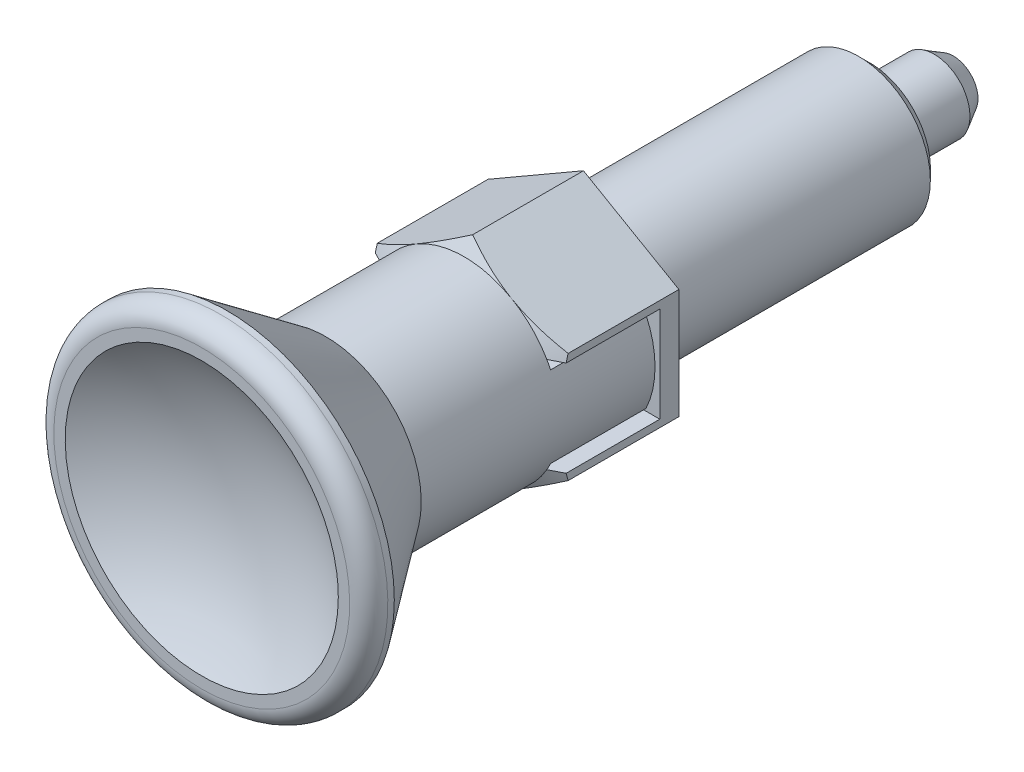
ISO-10303-21;
HEADER;
FILE_DESCRIPTION(('STEP AP214'),'2;1');
FILE_NAME('part.step','',(''),(''),'','','');
FILE_SCHEMA(('AUTOMOTIVE_DESIGN { 1 0 10303 214 1 1 1 1 }'));
ENDSEC;
DATA;
#1=APPLICATION_CONTEXT('core data for automotive mechanical design processes');
#2=APPLICATION_PROTOCOL_DEFINITION('international standard','automotive_design',2000,#1);
#3=PRODUCT_CONTEXT('',#1,'mechanical');
#4=PRODUCT('Part','Part','',(#3));
#5=PRODUCT_RELATED_PRODUCT_CATEGORY('part','',(#4));
#6=PRODUCT_DEFINITION_FORMATION('','',#4);
#7=PRODUCT_DEFINITION_CONTEXT('part definition',#1,'design');
#8=PRODUCT_DEFINITION('design','',#6,#7);
#9=PRODUCT_DEFINITION_SHAPE('','',#8);
#10=(LENGTH_UNIT() NAMED_UNIT(*) SI_UNIT(.MILLI.,.METRE.));
#11=(NAMED_UNIT(*) PLANE_ANGLE_UNIT() SI_UNIT($,.RADIAN.));
#12=(NAMED_UNIT(*) SI_UNIT($,.STERADIAN.) SOLID_ANGLE_UNIT());
#13=UNCERTAINTY_MEASURE_WITH_UNIT(LENGTH_MEASURE(1.E-05),#10,'distance_accuracy_value','');
#14=(GEOMETRIC_REPRESENTATION_CONTEXT(3) GLOBAL_UNCERTAINTY_ASSIGNED_CONTEXT((#13)) GLOBAL_UNIT_ASSIGNED_CONTEXT((#10,
#11,#12)) REPRESENTATION_CONTEXT('',''));
#15=CARTESIAN_POINT('',(0.,0.,0.));
#16=DIRECTION('',(0.,0.,1.));
#17=DIRECTION('',(1.,0.,0.));
#18=AXIS2_PLACEMENT_3D('',#15,#16,#17);
#19=CARTESIAN_POINT('',(0.,0.,0.));
#20=DIRECTION('',(0.,0.,1.));
#21=DIRECTION('',(0.,-1.,0.));
#22=AXIS2_PLACEMENT_3D('',#19,#20,#21);
#23=CYLINDRICAL_SURFACE('',#22,3.);
#24=CARTESIAN_POINT('',(0.,0.,0.));
#25=DIRECTION('',(0.,0.,1.));
#26=DIRECTION('',(0.,-1.,0.));
#27=AXIS2_PLACEMENT_3D('',#24,#25,#26);
#28=CIRCLE('',#27,3.);
#29=CARTESIAN_POINT('',(0.,-3.,0.));
#30=VERTEX_POINT('',#29);
#31=EDGE_CURVE('E614',#30,#30,#28,.T.);
#32=ORIENTED_EDGE('',*,*,#31,.F.);
#33=EDGE_LOOP('',(#32));
#34=FACE_BOUND('',#33,.T.);
#35=CARTESIAN_POINT('',(0.,0.,-11.54));
#36=DIRECTION('',(0.,0.,1.));
#37=DIRECTION('',(1.,0.,0.));
#38=AXIS2_PLACEMENT_3D('',#35,#36,#37);
#39=CIRCLE('',#38,3.);
#40=CARTESIAN_POINT('',(3.00000000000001,0.,-11.54));
#41=VERTEX_POINT('',#40);
#42=EDGE_CURVE('E125',#41,#41,#39,.T.);
#43=ORIENTED_EDGE('',*,*,#42,.T.);
#44=EDGE_LOOP('',(#43));
#45=FACE_BOUND('',#44,.T.);
#46=ADVANCED_FACE('F14',(#34,#45),#23,.T.);
#47=CARTESIAN_POINT('',(2.4,-2.,0.8));
#48=DIRECTION('',(0.,1.,0.));
#49=DIRECTION('',(0.,0.,1.));
#50=AXIS2_PLACEMENT_3D('',#47,#48,#49);
#51=PLANE('',#50);
#52=DIRECTION('',(0.,0.,1.));
#53=VECTOR('',#52,1.);
#54=CARTESIAN_POINT('',(2.4,-2.,0.8));
#55=LINE('',#54,#53);
#56=CARTESIAN_POINT('',(2.4,-2.,5.));
#57=VERTEX_POINT('',#56);
#58=CARTESIAN_POINT('',(2.4,-2.,0.8));
#59=VERTEX_POINT('',#58);
#60=EDGE_CURVE('E152',#57,#59,#55,.F.);
#61=ORIENTED_EDGE('',*,*,#60,.F.);
#62=DIRECTION('',(1.,0.,0.));
#63=VECTOR('',#62,1.);
#64=CARTESIAN_POINT('',(2.4,-2.,5.));
#65=LINE('',#64,#63);
#66=CARTESIAN_POINT('',(3.46410161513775,-2.,5.));
#67=VERTEX_POINT('',#66);
#68=EDGE_CURVE('E124',#57,#67,#65,.T.);
#69=ORIENTED_EDGE('',*,*,#68,.T.);
#70=CARTESIAN_POINT('',(3.46410161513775,-2.,5.));
#71=CARTESIAN_POINT('',(3.50891598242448,-2.00000000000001,4.97759246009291));
#72=CARTESIAN_POINT('',(3.55368710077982,-2.00000000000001,4.95509855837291));
#73=CARTESIAN_POINT('',(3.64314889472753,-2.00000000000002,4.90995250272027));
#74=CARTESIAN_POINT('',(3.68783957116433,-2.00000000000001,4.88730035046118));
#75=CARTESIAN_POINT('',(3.77714740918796,-2.00000000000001,4.8418518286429));
#76=CARTESIAN_POINT('',(3.8217645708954,-2.00000000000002,4.8190554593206));
#77=CARTESIAN_POINT('',(3.91093152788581,-2.00000000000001,4.77333017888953));
#78=CARTESIAN_POINT('',(3.95548132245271,-2.00000000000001,4.75040126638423));
#79=CARTESIAN_POINT('',(4.,-2.,4.72741217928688));
#80=B_SPLINE_CURVE_WITH_KNOTS('',3,(#70,#71,#72,#73,#74,#75,#76,#77,#78,#79),.UNSPECIFIED.,.F.,
.F.,(4,2,2,2,4),(0.,0.15031225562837,0.300622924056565,0.450933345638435,0.601245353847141),.UNSPECIFIED.);
#81=CARTESIAN_POINT('',(4.,-2.,4.72741217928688));
#82=VERTEX_POINT('',#81);
#83=EDGE_CURVE('E113',#67,#82,#80,.T.);
#84=ORIENTED_EDGE('',*,*,#83,.T.);
#85=DIRECTION('',(0.,0.,-1.));
#86=VECTOR('',#85,1.);
#87=CARTESIAN_POINT('',(4.,-2.,4.72741217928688));
#88=LINE('',#87,#86);
#89=CARTESIAN_POINT('',(4.,-2.,0.8));
#90=VERTEX_POINT('',#89);
#91=EDGE_CURVE('E168',#90,#82,#88,.F.);
#92=ORIENTED_EDGE('',*,*,#91,.F.);
#93=DIRECTION('',(1.,0.,0.));
#94=VECTOR('',#93,1.);
#95=CARTESIAN_POINT('',(2.4,-2.,0.8));
#96=LINE('',#95,#94);
#97=EDGE_CURVE('E154',#59,#90,#96,.T.);
#98=ORIENTED_EDGE('',*,*,#97,.F.);
#99=EDGE_LOOP('',(#61,#69,#84,#92,#98));
#100=FACE_BOUND('',#99,.T.);
#101=ADVANCED_FACE('F149',(#100),#51,.T.);
#102=CARTESIAN_POINT('',(2.4,2.,0.8));
#103=DIRECTION('',(0.,0.,1.));
#104=DIRECTION('',(0.,-1.,0.));
#105=AXIS2_PLACEMENT_3D('',#102,#103,#104);
#106=PLANE('',#105);
#107=DIRECTION('',(0.,1.,0.));
#108=VECTOR('',#107,1.);
#109=CARTESIAN_POINT('',(2.4,0.,0.8));
#110=LINE('',#109,#108);
#111=CARTESIAN_POINT('',(2.4,2.,0.8));
#112=VERTEX_POINT('',#111);
#113=EDGE_CURVE('E208',#59,#112,#110,.T.);
#114=ORIENTED_EDGE('',*,*,#113,.F.);
#115=ORIENTED_EDGE('',*,*,#97,.T.);
#116=DIRECTION('',(0.,-1.,0.));
#117=VECTOR('',#116,1.);
#118=CARTESIAN_POINT('',(4.,0.,0.8));
#119=LINE('',#118,#117);
#120=CARTESIAN_POINT('',(4.,2.,0.8));
#121=VERTEX_POINT('',#120);
#122=EDGE_CURVE('E341',#121,#90,#119,.T.);
#123=ORIENTED_EDGE('',*,*,#122,.F.);
#124=DIRECTION('',(1.,0.,0.));
#125=VECTOR('',#124,1.);
#126=CARTESIAN_POINT('',(2.4,2.,0.8));
#127=LINE('',#126,#125);
#128=EDGE_CURVE('E214',#112,#121,#127,.T.);
#129=ORIENTED_EDGE('',*,*,#128,.F.);
#130=EDGE_LOOP('',(#114,#115,#123,#129));
#131=FACE_BOUND('',#130,.T.);
#132=ADVANCED_FACE('F818',(#131),#106,.T.);
#133=CARTESIAN_POINT('',(2.4,2.,5.));
#134=DIRECTION('',(0.,-1.,0.));
#135=DIRECTION('',(0.,0.,-1.));
#136=AXIS2_PLACEMENT_3D('',#133,#134,#135);
#137=PLANE('',#136);
#138=ORIENTED_EDGE('',*,*,#128,.T.);
#139=DIRECTION('',(0.,0.,-1.));
#140=VECTOR('',#139,1.);
#141=CARTESIAN_POINT('',(4.,2.,4.7274121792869));
#142=LINE('',#141,#140);
#143=CARTESIAN_POINT('',(4.,2.,4.7274121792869));
#144=VERTEX_POINT('',#143);
#145=EDGE_CURVE('E198',#144,#121,#142,.T.);
#146=ORIENTED_EDGE('',*,*,#145,.F.);
#147=CARTESIAN_POINT('',(4.,2.,4.7274121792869));
#148=CARTESIAN_POINT('',(3.9554813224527,2.,4.75040126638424));
#149=CARTESIAN_POINT('',(3.91093152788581,2.,4.77333017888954));
#150=CARTESIAN_POINT('',(3.8217645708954,2.,4.81905545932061));
#151=CARTESIAN_POINT('',(3.77714740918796,2.,4.84185182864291));
#152=CARTESIAN_POINT('',(3.68783957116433,2.,4.88730035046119));
#153=CARTESIAN_POINT('',(3.64314889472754,2.,4.90995250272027));
#154=CARTESIAN_POINT('',(3.55368710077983,2.,4.95509855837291));
#155=CARTESIAN_POINT('',(3.50891598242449,2.,4.97759246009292));
#156=CARTESIAN_POINT('',(3.46410161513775,2.,5.));
#157=B_SPLINE_CURVE_WITH_KNOTS('',3,(#147,#148,#149,#150,#151,#152,#153,#154,#155,#156),
.UNSPECIFIED.,.F.,.F.,(4,2,2,2,4),(0.,0.150312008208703,0.30062242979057,0.45093309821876,
0.601245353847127),.UNSPECIFIED.);
#158=CARTESIAN_POINT('',(3.46410161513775,2.,5.));
#159=VERTEX_POINT('',#158);
#160=EDGE_CURVE('E157',#144,#159,#157,.T.);
#161=ORIENTED_EDGE('',*,*,#160,.T.);
#162=DIRECTION('',(1.,0.,0.));
#163=VECTOR('',#162,1.);
#164=CARTESIAN_POINT('',(2.4,2.,5.));
#165=LINE('',#164,#163);
#166=CARTESIAN_POINT('',(2.4,2.,5.));
#167=VERTEX_POINT('',#166);
#168=EDGE_CURVE('E211',#159,#167,#165,.F.);
#169=ORIENTED_EDGE('',*,*,#168,.T.);
#170=DIRECTION('',(0.,0.,1.));
#171=VECTOR('',#170,1.);
#172=CARTESIAN_POINT('',(2.4,2.,0.8));
#173=LINE('',#172,#171);
#174=EDGE_CURVE('E199',#112,#167,#173,.T.);
#175=ORIENTED_EDGE('',*,*,#174,.F.);
#176=EDGE_LOOP('',(#138,#146,#161,#169,#175));
#177=FACE_BOUND('',#176,.T.);
#178=ADVANCED_FACE('F628',(#177),#137,.T.);
#179=CARTESIAN_POINT('',(4.,2.30940107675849,4.75577665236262));
#180=DIRECTION('',(1.,0.,0.));
#181=DIRECTION('',(0.,-1.,0.));
#182=AXIS2_PLACEMENT_3D('',#179,#180,#181);
#183=PLANE('',#182);
#184=ORIENTED_EDGE('',*,*,#145,.T.);
#185=ORIENTED_EDGE('',*,*,#122,.T.);
#186=ORIENTED_EDGE('',*,*,#91,.T.);
#187=CARTESIAN_POINT('',(4.,-2.00000000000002,4.72741217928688));
#188=CARTESIAN_POINT('',(4.,-2.01271586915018,4.7241288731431));
#189=CARTESIAN_POINT('',(4.,-2.02542566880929,4.72082207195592));
#190=CARTESIAN_POINT('',(4.,-2.05089730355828,4.71414539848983));
#191=CARTESIAN_POINT('',(4.,-2.06365907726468,4.71077529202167));
#192=CARTESIAN_POINT('',(4.,-2.08923465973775,4.70397200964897));
#193=CARTESIAN_POINT('',(4.,-2.10204840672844,4.70053860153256));
#194=CARTESIAN_POINT('',(4.,-2.12772793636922,4.6936087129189));
#195=CARTESIAN_POINT('',(4.,-2.14059365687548,4.69011200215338));
#196=CARTESIAN_POINT('',(4.,-2.1663771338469,4.68305550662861));
#197=CARTESIAN_POINT('',(4.,-2.17929482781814,4.67949549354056));
#198=CARTESIAN_POINT('',(4.,-2.20518225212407,4.67231239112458));
#199=CARTESIAN_POINT('',(4.,-2.21815191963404,4.66868907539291));
#200=CARTESIAN_POINT('',(4.,-2.2441432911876,4.66137936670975));
#201=CARTESIAN_POINT('',(4.,-2.25716493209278,4.6576927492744));
#202=CARTESIAN_POINT('',(4.,-2.28326025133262,4.6502564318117));
#203=CARTESIAN_POINT('',(4.,-2.29633386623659,4.64650650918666));
#204=CARTESIAN_POINT('',(4.,-2.30940107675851,4.64273441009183));
#205=B_SPLINE_CURVE_WITH_KNOTS('',3,(#187,#188,#189,#190,#191,#192,#193,#194,#195,#196,#197,
#198,#199,#200,#201,#202,#203,#204),.UNSPECIFIED.,.F.,.F.,(4,2,2,2,2,2,2,2,4),(0.,
0.0393987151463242,0.0789964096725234,0.118793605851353,0.158790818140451,0.198988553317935,
0.239387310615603,0.279987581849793,0.320789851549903),.UNSPECIFIED.);
#206=CARTESIAN_POINT('',(4.,-2.30940107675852,4.64273441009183));
#207=VERTEX_POINT('',#206);
#208=EDGE_CURVE('E119',#82,#207,#205,.T.);
#209=ORIENTED_EDGE('',*,*,#208,.T.);
#210=DIRECTION('',(0.,0.,-1.));
#211=VECTOR('',#210,1.);
#212=CARTESIAN_POINT('',(4.,-2.30940107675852,5.));
#213=LINE('',#212,#211);
#214=CARTESIAN_POINT('',(4.,-2.3094010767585,0.));
#215=VERTEX_POINT('',#214);
#216=EDGE_CURVE('E227',#215,#207,#213,.F.);
#217=ORIENTED_EDGE('',*,*,#216,.F.);
#218=DIRECTION('',(0.,1.,0.));
#219=VECTOR('',#218,1.);
#220=CARTESIAN_POINT('',(4.,-4.61880215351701,0.));
#221=LINE('',#220,#219);
#222=CARTESIAN_POINT('',(4.,2.3094010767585,0.));
#223=VERTEX_POINT('',#222);
#224=EDGE_CURVE('E349',#223,#215,#221,.F.);
#225=ORIENTED_EDGE('',*,*,#224,.F.);
#226=DIRECTION('',(0.,0.,-1.));
#227=VECTOR('',#226,1.);
#228=CARTESIAN_POINT('',(4.,2.30940107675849,5.));
#229=LINE('',#228,#227);
#230=CARTESIAN_POINT('',(4.,2.30940107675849,4.64273441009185));
#231=VERTEX_POINT('',#230);
#232=EDGE_CURVE('E516',#231,#223,#229,.T.);
#233=ORIENTED_EDGE('',*,*,#232,.F.);
#234=CARTESIAN_POINT('',(4.,2.30940107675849,4.64273441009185));
#235=CARTESIAN_POINT('',(4.,2.29633386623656,4.64650650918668));
#236=CARTESIAN_POINT('',(4.,2.28326025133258,4.65025643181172));
#237=CARTESIAN_POINT('',(4.,2.25716493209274,4.65769274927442));
#238=CARTESIAN_POINT('',(4.,2.24414329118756,4.66137936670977));
#239=CARTESIAN_POINT('',(4.,2.21815191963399,4.66868907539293));
#240=CARTESIAN_POINT('',(4.,2.20518225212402,4.6723123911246));
#241=CARTESIAN_POINT('',(4.,2.17929482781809,4.67949549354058));
#242=CARTESIAN_POINT('',(4.,2.16637713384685,4.68305550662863));
#243=CARTESIAN_POINT('',(4.,2.14059365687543,4.6901120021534));
#244=CARTESIAN_POINT('',(4.,2.12772793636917,4.69360871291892));
#245=CARTESIAN_POINT('',(4.,2.1020484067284,4.70053860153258));
#246=CARTESIAN_POINT('',(4.,2.08923465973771,4.70397200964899));
#247=CARTESIAN_POINT('',(4.,2.06365907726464,4.71077529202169));
#248=CARTESIAN_POINT('',(4.,2.05089730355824,4.71414539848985));
#249=CARTESIAN_POINT('',(4.,2.02542566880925,4.72082207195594));
#250=CARTESIAN_POINT('',(4.,2.01271586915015,4.72412887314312));
#251=CARTESIAN_POINT('',(4.,1.99999999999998,4.7274121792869));
#252=B_SPLINE_CURVE_WITH_KNOTS('',3,(#234,#235,#236,#237,#238,#239,#240,#241,#242,#243,#244,
#245,#246,#247,#248,#249,#250,#251),.UNSPECIFIED.,.F.,.F.,(4,2,2,2,2,2,2,2,4),(0.,
0.0408022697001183,0.0814025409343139,0.121801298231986,0.161999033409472,0.201996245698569,
0.241793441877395,0.281391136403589,0.320789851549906),.UNSPECIFIED.);
#253=EDGE_CURVE('E167',#231,#144,#252,.T.);
#254=ORIENTED_EDGE('',*,*,#253,.T.);
#255=EDGE_LOOP('',(#184,#185,#186,#209,#217,#225,#233,#254));
#256=FACE_BOUND('',#255,.T.);
#257=ADVANCED_FACE('F182',(#256),#183,.T.);
#258=CARTESIAN_POINT('',(4.,-4.67422777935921,0.));
#259=DIRECTION('',(0.,0.,-1.));
#260=DIRECTION('',(-1.,0.,0.));
#261=AXIS2_PLACEMENT_3D('',#258,#259,#260);
#262=PLANE('',#261);
#263=ORIENTED_EDGE('',*,*,#31,.T.);
#264=EDGE_LOOP('',(#263));
#265=FACE_BOUND('',#264,.T.);
#266=DIRECTION('',(0.,-1.,0.));
#267=VECTOR('',#266,1.);
#268=CARTESIAN_POINT('',(-4.,0.,0.));
#269=LINE('',#268,#267);
#270=CARTESIAN_POINT('',(-4.,2.3094010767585,0.));
#271=VERTEX_POINT('',#270);
#272=CARTESIAN_POINT('',(-4.,-2.3094010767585,0.));
#273=VERTEX_POINT('',#272);
#274=EDGE_CURVE('E302',#271,#273,#269,.T.);
#275=ORIENTED_EDGE('',*,*,#274,.F.);
#276=DIRECTION('',(-0.866025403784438,-0.5,0.));
#277=VECTOR('',#276,1.);
#278=CARTESIAN_POINT('',(-2.,3.46410161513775,0.));
#279=LINE('',#278,#277);
#280=CARTESIAN_POINT('',(0.,4.61880215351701,0.));
#281=VERTEX_POINT('',#280);
#282=EDGE_CURVE('E507',#281,#271,#279,.T.);
#283=ORIENTED_EDGE('',*,*,#282,.F.);
#284=DIRECTION('',(-0.866025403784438,0.5,0.));
#285=VECTOR('',#284,1.);
#286=CARTESIAN_POINT('',(2.,3.46410161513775,0.));
#287=LINE('',#286,#285);
#288=EDGE_CURVE('E513',#223,#281,#287,.T.);
#289=ORIENTED_EDGE('',*,*,#288,.F.);
#290=ORIENTED_EDGE('',*,*,#224,.T.);
#291=DIRECTION('',(0.866025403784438,0.5,0.));
#292=VECTOR('',#291,1.);
#293=CARTESIAN_POINT('',(2.,-3.46410161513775,0.));
#294=LINE('',#293,#292);
#295=CARTESIAN_POINT('',(0.,-4.61880215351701,0.));
#296=VERTEX_POINT('',#295);
#297=EDGE_CURVE('E169',#296,#215,#294,.T.);
#298=ORIENTED_EDGE('',*,*,#297,.F.);
#299=DIRECTION('',(0.866025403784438,-0.5,0.));
#300=VECTOR('',#299,1.);
#301=CARTESIAN_POINT('',(-2.,-3.46410161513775,0.));
#302=LINE('',#301,#300);
#303=EDGE_CURVE('E243',#273,#296,#302,.T.);
#304=ORIENTED_EDGE('',*,*,#303,.F.);
#305=EDGE_LOOP('',(#275,#283,#289,#290,#298,#304));
#306=FACE_BOUND('',#305,.T.);
#307=ADVANCED_FACE('F180',(#265,#306),#262,.T.);
#308=CARTESIAN_POINT('',(-4.,-2.30940107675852,4.7557766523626));
#309=DIRECTION('',(-1.,0.,0.));
#310=DIRECTION('',(0.,1.,0.));
#311=AXIS2_PLACEMENT_3D('',#308,#309,#310);
#312=PLANE('',#311);
#313=CARTESIAN_POINT('',(-4.,-2.30940107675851,4.64273441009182));
#314=CARTESIAN_POINT('',(-4.,-2.29633386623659,4.64650650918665));
#315=CARTESIAN_POINT('',(-4.,-2.28326025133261,4.65025643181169));
#316=CARTESIAN_POINT('',(-4.,-2.25716493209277,4.65769274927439));
#317=CARTESIAN_POINT('',(-4.,-2.24414329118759,4.66137936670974));
#318=CARTESIAN_POINT('',(-4.,-2.21815191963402,4.66868907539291));
#319=CARTESIAN_POINT('',(-4.,-2.20518225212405,4.67231239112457));
#320=CARTESIAN_POINT('',(-4.,-2.17929482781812,4.67949549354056));
#321=CARTESIAN_POINT('',(-4.,-2.16637713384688,4.68305550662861));
#322=CARTESIAN_POINT('',(-4.,-2.14059365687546,4.69011200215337));
#323=CARTESIAN_POINT('',(-4.,-2.12772793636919,4.6936087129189));
#324=CARTESIAN_POINT('',(-4.,-2.10204840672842,4.70053860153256));
#325=CARTESIAN_POINT('',(-4.,-2.08923465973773,4.70397200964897));
#326=CARTESIAN_POINT('',(-4.,-2.06365907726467,4.71077529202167));
#327=CARTESIAN_POINT('',(-4.,-2.05089730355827,4.71414539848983));
#328=CARTESIAN_POINT('',(-4.,-2.02542566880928,4.72082207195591));
#329=CARTESIAN_POINT('',(-4.,-2.01271586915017,4.7241288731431));
#330=CARTESIAN_POINT('',(-4.,-2.00000000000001,4.72741217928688));
#331=B_SPLINE_CURVE_WITH_KNOTS('',3,(#313,#314,#315,#316,#317,#318,#319,#320,#321,#322,#323,
#324,#325,#326,#327,#328,#329,#330),.UNSPECIFIED.,.F.,.F.,(4,2,2,2,2,2,2,2,4),(0.,
0.0408022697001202,0.0814025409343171,0.12180129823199,0.161999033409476,0.201996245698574,
0.241793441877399,0.281391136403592,0.320789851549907),.UNSPECIFIED.);
#332=CARTESIAN_POINT('',(-4.,-2.30940107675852,4.64273441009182));
#333=VERTEX_POINT('',#332);
#334=CARTESIAN_POINT('',(-4.,-2.,4.72741217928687));
#335=VERTEX_POINT('',#334);
#336=EDGE_CURVE('E297',#333,#335,#331,.T.);
#337=ORIENTED_EDGE('',*,*,#336,.T.);
#338=DIRECTION('',(0.,0.,1.));
#339=VECTOR('',#338,1.);
#340=CARTESIAN_POINT('',(-4.,-2.,2.9));
#341=LINE('',#340,#339);
#342=CARTESIAN_POINT('',(-4.,-2.,0.8));
#343=VERTEX_POINT('',#342);
#344=EDGE_CURVE('E301',#343,#335,#341,.T.);
#345=ORIENTED_EDGE('',*,*,#344,.F.);
#346=DIRECTION('',(0.,-1.,0.));
#347=VECTOR('',#346,1.);
#348=CARTESIAN_POINT('',(-4.,0.,0.8));
#349=LINE('',#348,#347);
#350=CARTESIAN_POINT('',(-4.,2.,0.8));
#351=VERTEX_POINT('',#350);
#352=EDGE_CURVE('E315',#351,#343,#349,.T.);
#353=ORIENTED_EDGE('',*,*,#352,.F.);
#354=DIRECTION('',(0.,0.,-1.));
#355=VECTOR('',#354,1.);
#356=CARTESIAN_POINT('',(-4.,2.,2.9));
#357=LINE('',#356,#355);
#358=CARTESIAN_POINT('',(-4.,2.,4.72741217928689));
#359=VERTEX_POINT('',#358);
#360=EDGE_CURVE('E263',#359,#351,#357,.T.);
#361=ORIENTED_EDGE('',*,*,#360,.F.);
#362=CARTESIAN_POINT('',(-4.,1.99999999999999,4.72741217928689));
#363=CARTESIAN_POINT('',(-4.,2.01271586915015,4.72412887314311));
#364=CARTESIAN_POINT('',(-4.,2.02542566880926,4.72082207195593));
#365=CARTESIAN_POINT('',(-4.,2.05089730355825,4.71414539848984));
#366=CARTESIAN_POINT('',(-4.,2.06365907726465,4.71077529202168));
#367=CARTESIAN_POINT('',(-4.,2.08923465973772,4.70397200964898));
#368=CARTESIAN_POINT('',(-4.,2.10204840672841,4.70053860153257));
#369=CARTESIAN_POINT('',(-4.,2.12772793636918,4.69360871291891));
#370=CARTESIAN_POINT('',(-4.,2.14059365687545,4.69011200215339));
#371=CARTESIAN_POINT('',(-4.,2.16637713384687,4.68305550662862));
#372=CARTESIAN_POINT('',(-4.,2.17929482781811,4.67949549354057));
#373=CARTESIAN_POINT('',(-4.,2.20518225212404,4.67231239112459));
#374=CARTESIAN_POINT('',(-4.,2.218151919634,4.66868907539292));
#375=CARTESIAN_POINT('',(-4.,2.24414329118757,4.66137936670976));
#376=CARTESIAN_POINT('',(-4.,2.25716493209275,4.65769274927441));
#377=CARTESIAN_POINT('',(-4.,2.28326025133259,4.65025643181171));
#378=CARTESIAN_POINT('',(-4.,2.29633386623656,4.64650650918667));
#379=CARTESIAN_POINT('',(-4.,2.30940107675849,4.64273441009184));
#380=B_SPLINE_CURVE_WITH_KNOTS('',3,(#362,#363,#364,#365,#366,#367,#368,#369,#370,#371,#372,
#373,#374,#375,#376,#377,#378,#379),.UNSPECIFIED.,.F.,.F.,(4,2,2,2,2,2,2,2,4),(0.,
0.0393987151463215,0.0789964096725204,0.118793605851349,0.158790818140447,0.19898855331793,
0.239387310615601,0.279987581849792,0.320789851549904),.UNSPECIFIED.);
#381=CARTESIAN_POINT('',(-4.,2.30940107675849,4.64273441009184));
#382=VERTEX_POINT('',#381);
#383=EDGE_CURVE('E282',#359,#382,#380,.T.);
#384=ORIENTED_EDGE('',*,*,#383,.T.);
#385=DIRECTION('',(0.,0.,-1.));
#386=VECTOR('',#385,1.);
#387=CARTESIAN_POINT('',(-4.,2.30940107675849,5.));
#388=LINE('',#387,#386);
#389=EDGE_CURVE('E336',#271,#382,#388,.F.);
#390=ORIENTED_EDGE('',*,*,#389,.F.);
#391=ORIENTED_EDGE('',*,*,#274,.T.);
#392=DIRECTION('',(0.,0.,-1.));
#393=VECTOR('',#392,1.);
#394=CARTESIAN_POINT('',(-4.,-2.30940107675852,5.));
#395=LINE('',#394,#393);
#396=EDGE_CURVE('E246',#333,#273,#395,.T.);
#397=ORIENTED_EDGE('',*,*,#396,.F.);
#398=EDGE_LOOP('',(#337,#345,#353,#361,#384,#390,#391,#397));
#399=FACE_BOUND('',#398,.T.);
#400=ADVANCED_FACE('F294',(#399),#312,.T.);
#401=CARTESIAN_POINT('',(-2.4,-2.,5.));
#402=DIRECTION('',(0.,1.,0.));
#403=DIRECTION('',(0.,0.,-1.));
#404=AXIS2_PLACEMENT_3D('',#401,#402,#403);
#405=PLANE('',#404);
#406=DIRECTION('',(0.,0.,1.));
#407=VECTOR('',#406,1.);
#408=CARTESIAN_POINT('',(-2.4,-2.,0.8));
#409=LINE('',#408,#407);
#410=CARTESIAN_POINT('',(-2.4,-2.,0.8));
#411=VERTEX_POINT('',#410);
#412=CARTESIAN_POINT('',(-2.4,-2.,5.));
#413=VERTEX_POINT('',#412);
#414=EDGE_CURVE('E333',#411,#413,#409,.T.);
#415=ORIENTED_EDGE('',*,*,#414,.F.);
#416=DIRECTION('',(1.,0.,0.));
#417=VECTOR('',#416,1.);
#418=CARTESIAN_POINT('',(-4.,-2.,0.8));
#419=LINE('',#418,#417);
#420=EDGE_CURVE('E275',#343,#411,#419,.T.);
#421=ORIENTED_EDGE('',*,*,#420,.F.);
#422=ORIENTED_EDGE('',*,*,#344,.T.);
#423=CARTESIAN_POINT('',(-4.,-2.,4.72741217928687));
#424=CARTESIAN_POINT('',(-3.95548132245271,-2.,4.75040126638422));
#425=CARTESIAN_POINT('',(-3.91093152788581,-2.,4.77333017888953));
#426=CARTESIAN_POINT('',(-3.8217645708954,-2.,4.8190554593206));
#427=CARTESIAN_POINT('',(-3.77714740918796,-2.,4.84185182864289));
#428=CARTESIAN_POINT('',(-3.68783957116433,-2.,4.88730035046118));
#429=CARTESIAN_POINT('',(-3.64314889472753,-2.,4.90995250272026));
#430=CARTESIAN_POINT('',(-3.55368710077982,-2.,4.9550985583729));
#431=CARTESIAN_POINT('',(-3.50891598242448,-2.,4.97759246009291));
#432=CARTESIAN_POINT('',(-3.46410161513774,-2.,5.));
#433=B_SPLINE_CURVE_WITH_KNOTS('',3,(#423,#424,#425,#426,#427,#428,#429,#430,#431,#432),
.UNSPECIFIED.,.F.,.F.,(4,2,2,2,4),(0.,0.150312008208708,0.300622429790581,0.450933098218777,
0.60124535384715),.UNSPECIFIED.);
#434=CARTESIAN_POINT('',(-3.46410161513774,-2.,5.));
#435=VERTEX_POINT('',#434);
#436=EDGE_CURVE('E326',#335,#435,#433,.T.);
#437=ORIENTED_EDGE('',*,*,#436,.T.);
#438=DIRECTION('',(-1.,0.,0.));
#439=VECTOR('',#438,1.);
#440=CARTESIAN_POINT('',(-2.4,-2.,5.));
#441=LINE('',#440,#439);
#442=EDGE_CURVE('E312',#435,#413,#441,.F.);
#443=ORIENTED_EDGE('',*,*,#442,.T.);
#444=EDGE_LOOP('',(#415,#421,#422,#437,#443));
#445=FACE_BOUND('',#444,.T.);
#446=ADVANCED_FACE('F291',(#445),#405,.T.);
#447=CARTESIAN_POINT('',(-2.4,2.,0.8));
#448=DIRECTION('',(0.,-1.,0.));
#449=DIRECTION('',(0.,0.,1.));
#450=AXIS2_PLACEMENT_3D('',#447,#448,#449);
#451=PLANE('',#450);
#452=DIRECTION('',(-1.,0.,0.));
#453=VECTOR('',#452,1.);
#454=CARTESIAN_POINT('',(-2.4,2.,5.));
#455=LINE('',#454,#453);
#456=CARTESIAN_POINT('',(-2.4,2.,5.));
#457=VERTEX_POINT('',#456);
#458=CARTESIAN_POINT('',(-3.46410161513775,2.,5.));
#459=VERTEX_POINT('',#458);
#460=EDGE_CURVE('E259',#457,#459,#455,.T.);
#461=ORIENTED_EDGE('',*,*,#460,.T.);
#462=CARTESIAN_POINT('',(-3.46410161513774,2.,5.));
#463=CARTESIAN_POINT('',(-3.50891598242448,1.99999999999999,4.97759246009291));
#464=CARTESIAN_POINT('',(-3.55368710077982,1.99999999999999,4.95509855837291));
#465=CARTESIAN_POINT('',(-3.64314889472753,1.99999999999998,4.90995250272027));
#466=CARTESIAN_POINT('',(-3.68783957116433,1.99999999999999,4.88730035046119));
#467=CARTESIAN_POINT('',(-3.77714740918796,1.99999999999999,4.8418518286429));
#468=CARTESIAN_POINT('',(-3.8217645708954,1.99999999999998,4.81905545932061));
#469=CARTESIAN_POINT('',(-3.91093152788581,1.99999999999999,4.77333017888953));
#470=CARTESIAN_POINT('',(-3.9554813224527,1.99999999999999,4.75040126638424));
#471=CARTESIAN_POINT('',(-4.,2.,4.72741217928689));
#472=B_SPLINE_CURVE_WITH_KNOTS('',3,(#462,#463,#464,#465,#466,#467,#468,#469,#470,#471),
.UNSPECIFIED.,.F.,.F.,(4,2,2,2,4),(0.,0.15031225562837,0.300622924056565,0.450933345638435,
0.601245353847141),.UNSPECIFIED.);
#473=EDGE_CURVE('E262',#459,#359,#472,.T.);
#474=ORIENTED_EDGE('',*,*,#473,.T.);
#475=ORIENTED_EDGE('',*,*,#360,.T.);
#476=DIRECTION('',(1.,0.,0.));
#477=VECTOR('',#476,1.);
#478=CARTESIAN_POINT('',(-4.,2.,0.8));
#479=LINE('',#478,#477);
#480=CARTESIAN_POINT('',(-2.4,2.,0.8));
#481=VERTEX_POINT('',#480);
#482=EDGE_CURVE('E249',#481,#351,#479,.F.);
#483=ORIENTED_EDGE('',*,*,#482,.F.);
#484=DIRECTION('',(0.,0.,1.));
#485=VECTOR('',#484,1.);
#486=CARTESIAN_POINT('',(-2.4,2.,0.8));
#487=LINE('',#486,#485);
#488=EDGE_CURVE('E270',#457,#481,#487,.F.);
#489=ORIENTED_EDGE('',*,*,#488,.F.);
#490=EDGE_LOOP('',(#461,#474,#475,#483,#489));
#491=FACE_BOUND('',#490,.T.);
#492=ADVANCED_FACE('F1076',(#491),#451,.T.);
#493=CARTESIAN_POINT('',(-4.,2.,0.8));
#494=DIRECTION('',(0.,0.,1.));
#495=DIRECTION('',(0.,-1.,0.));
#496=AXIS2_PLACEMENT_3D('',#493,#494,#495);
#497=PLANE('',#496);
#498=DIRECTION('',(0.,-1.,0.));
#499=VECTOR('',#498,1.);
#500=CARTESIAN_POINT('',(-2.4,0.,0.8));
#501=LINE('',#500,#499);
#502=EDGE_CURVE('E266',#481,#411,#501,.T.);
#503=ORIENTED_EDGE('',*,*,#502,.F.);
#504=ORIENTED_EDGE('',*,*,#482,.T.);
#505=ORIENTED_EDGE('',*,*,#352,.T.);
#506=ORIENTED_EDGE('',*,*,#420,.T.);
#507=EDGE_LOOP('',(#503,#504,#505,#506));
#508=FACE_BOUND('',#507,.T.);
#509=ADVANCED_FACE('F1085',(#508),#497,.T.);
#510=CARTESIAN_POINT('',(0.,-4.61880215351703,5.03));
#511=DIRECTION('',(-0.5,-0.866025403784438,0.));
#512=DIRECTION('',(-0.866025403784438,0.5,0.));
#513=AXIS2_PLACEMENT_3D('',#510,#511,#512);
#514=PLANE('',#513);
#515=ORIENTED_EDGE('',*,*,#303,.T.);
#516=DIRECTION('',(0.,0.,-1.));
#517=VECTOR('',#516,1.);
#518=CARTESIAN_POINT('',(0.,-4.61880215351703,5.));
#519=LINE('',#518,#517);
#520=CARTESIAN_POINT('',(0.,-4.61880215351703,4.64273441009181));
#521=VERTEX_POINT('',#520);
#522=EDGE_CURVE('E240',#521,#296,#519,.T.);
#523=ORIENTED_EDGE('',*,*,#522,.F.);
#524=CARTESIAN_POINT('',(-2.,-3.46410161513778,5.));
#525=CARTESIAN_POINT('',(-1.91511121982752,-3.51311217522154,5.00001634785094));
#526=CARTESIAN_POINT('',(-1.8302265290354,-3.56212037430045,4.99792016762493));
#527=CARTESIAN_POINT('',(-1.66062381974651,-3.66004054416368,4.98962425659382));
#528=CARTESIAN_POINT('',(-1.57590577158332,-3.70895253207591,4.98342533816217));
#529=CARTESIAN_POINT('',(-1.40718355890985,-3.80636434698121,4.96708627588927));
#530=CARTESIAN_POINT('',(-1.3231779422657,-3.85486501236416,4.95696597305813));
#531=CARTESIAN_POINT('',(-1.15556694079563,-3.95163526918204,4.93300183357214));
#532=CARTESIAN_POINT('',(-1.07196156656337,-3.99990485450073,4.91915789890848));
#533=CARTESIAN_POINT('',(-0.822092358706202,-4.14416690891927,4.8724683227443));
#534=CARTESIAN_POINT('',(-0.656554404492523,-4.23974029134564,4.83444223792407));
#535=CARTESIAN_POINT('',(-0.326902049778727,-4.43006516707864,4.74674436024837));
#536=CARTESIAN_POINT('',(-0.162799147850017,-4.52481002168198,4.69701440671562));
#537=CARTESIAN_POINT('',(0.,-4.61880215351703,4.64273441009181));
#538=B_SPLINE_CURVE_WITH_KNOTS('',3,(#524,#525,#526,#527,#528,#529,#530,#531,#532,#533,#534,
#535,#536,#537),.UNSPECIFIED.,.F.,.F.,(4,2,2,2,2,2,4),(0.,0.2940333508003,0.588008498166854,
0.880515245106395,1.17302969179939,1.75729191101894,2.34452123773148),.UNSPECIFIED.);
#539=CARTESIAN_POINT('',(-2.,-3.46410161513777,5.));
#540=VERTEX_POINT('',#539);
#541=EDGE_CURVE('E539',#540,#521,#538,.T.);
#542=ORIENTED_EDGE('',*,*,#541,.F.);
#543=CARTESIAN_POINT('',(-3.99999999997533,-2.30940107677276,4.64273441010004));
#544=CARTESIAN_POINT('',(-3.83720085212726,-2.40339320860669,4.6970144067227));
#545=CARTESIAN_POINT('',(-3.67309795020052,-2.49813806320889,4.74674436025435));
#546=CARTESIAN_POINT('',(-3.34344559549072,-2.6884629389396,4.83444223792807));
#547=CARTESIAN_POINT('',(-3.17790764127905,-2.7840363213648,4.87246832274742));
#548=CARTESIAN_POINT('',(-2.92803843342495,-2.92829837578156,4.91915789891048));
#549=CARTESIAN_POINT('',(-2.84443305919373,-2.97656796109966,4.93300183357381));
#550=CARTESIAN_POINT('',(-2.67682205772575,-3.07333821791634,4.95696597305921));
#551=CARTESIAN_POINT('',(-2.59281644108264,-3.12183888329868,4.9670862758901));
#552=CARTESIAN_POINT('',(-2.42409422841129,-3.21925069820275,4.98342533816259));
#553=CARTESIAN_POINT('',(-2.33937618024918,-3.26816268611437,4.98962425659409));
#554=CARTESIAN_POINT('',(-2.16977347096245,-3.36608285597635,4.99792016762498));
#555=CARTESIAN_POINT('',(-2.0848887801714,-3.41509105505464,5.00001634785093));
#556=CARTESIAN_POINT('',(-2.,-3.46410161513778,5.));
#557=B_SPLINE_CURVE_WITH_KNOTS('',3,(#543,#544,#545,#546,#547,#548,#549,#550,#551,#552,#553,
#554,#555,#556),.UNSPECIFIED.,.F.,.F.,(4,2,2,2,2,2,4),(0.,0.587229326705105,1.17149154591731,
1.46400599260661,1.75651273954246,2.05048788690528,2.34452123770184),.UNSPECIFIED.);
#558=EDGE_CURVE('E255',#333,#540,#557,.T.);
#559=ORIENTED_EDGE('',*,*,#558,.F.);
#560=ORIENTED_EDGE('',*,*,#396,.T.);
#561=EDGE_LOOP('',(#515,#523,#542,#559,#560));
#562=FACE_BOUND('',#561,.T.);
#563=ADVANCED_FACE('F572',(#562),#514,.T.);
#564=CARTESIAN_POINT('',(4.,-2.30940107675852,5.03));
#565=DIRECTION('',(0.5,-0.866025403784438,0.));
#566=DIRECTION('',(-0.866025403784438,-0.5,0.));
#567=AXIS2_PLACEMENT_3D('',#564,#565,#566);
#568=PLANE('',#567);
#569=ORIENTED_EDGE('',*,*,#297,.T.);
#570=ORIENTED_EDGE('',*,*,#216,.T.);
#571=CARTESIAN_POINT('',(2.,-3.46410161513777,5.));
#572=CARTESIAN_POINT('',(2.0848887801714,-3.41509105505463,5.00001634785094));
#573=CARTESIAN_POINT('',(2.16977347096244,-3.36608285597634,4.99792016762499));
#574=CARTESIAN_POINT('',(2.33937618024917,-3.26816268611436,4.9896242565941));
#575=CARTESIAN_POINT('',(2.42409422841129,-3.21925069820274,4.9834253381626));
#576=CARTESIAN_POINT('',(2.59281644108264,-3.12183888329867,4.96708627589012));
#577=CARTESIAN_POINT('',(2.67682205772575,-3.07333821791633,4.95696597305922));
#578=CARTESIAN_POINT('',(2.84443305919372,-2.97656796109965,4.93300183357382));
#579=CARTESIAN_POINT('',(2.92803843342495,-2.92829837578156,4.9191578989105));
#580=CARTESIAN_POINT('',(3.17790764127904,-2.7840363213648,4.87246832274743));
#581=CARTESIAN_POINT('',(3.34344559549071,-2.68846293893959,4.83444223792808));
#582=CARTESIAN_POINT('',(3.67309795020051,-2.49813806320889,4.74674436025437));
#583=CARTESIAN_POINT('',(3.83720085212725,-2.40339320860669,4.69701440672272));
#584=CARTESIAN_POINT('',(3.99999999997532,-2.30940107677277,4.64273441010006));
#585=B_SPLINE_CURVE_WITH_KNOTS('',3,(#571,#572,#573,#574,#575,#576,#577,#578,#579,#580,#581,
#582,#583,#584),.UNSPECIFIED.,.F.,.F.,(4,2,2,2,2,2,4),(0.,0.294033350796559,0.588008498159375,
0.880515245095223,1.17302969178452,1.75729191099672,2.34452123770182),.UNSPECIFIED.);
#586=CARTESIAN_POINT('',(2.,-3.46410161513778,5.));
#587=VERTEX_POINT('',#586);
#588=EDGE_CURVE('E536',#587,#207,#585,.T.);
#589=ORIENTED_EDGE('',*,*,#588,.F.);
#590=CARTESIAN_POINT('',(0.,-4.61880215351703,4.64273441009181));
#591=CARTESIAN_POINT('',(0.162799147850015,-4.52481002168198,4.69701440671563));
#592=CARTESIAN_POINT('',(0.326902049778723,-4.43006516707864,4.74674436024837));
#593=CARTESIAN_POINT('',(0.656554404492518,-4.23974029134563,4.83444223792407));
#594=CARTESIAN_POINT('',(0.822092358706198,-4.14416690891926,4.8724683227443));
#595=CARTESIAN_POINT('',(1.07196156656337,-3.99990485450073,4.91915789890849));
#596=CARTESIAN_POINT('',(1.15556694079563,-3.95163526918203,4.93300183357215));
#597=CARTESIAN_POINT('',(1.32317794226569,-3.85486501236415,4.95696597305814));
#598=CARTESIAN_POINT('',(1.40718355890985,-3.8063643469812,4.96708627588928));
#599=CARTESIAN_POINT('',(1.57590577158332,-3.70895253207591,4.98342533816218));
#600=CARTESIAN_POINT('',(1.66062381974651,-3.66004054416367,4.98962425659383));
#601=CARTESIAN_POINT('',(1.83022652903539,-3.56212037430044,4.99792016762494));
#602=CARTESIAN_POINT('',(1.91511121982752,-3.51311217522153,5.00001634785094));
#603=CARTESIAN_POINT('',(2.,-3.46410161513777,5.));
#604=B_SPLINE_CURVE_WITH_KNOTS('',3,(#590,#591,#592,#593,#594,#595,#596,#597,#598,#599,#600,
#601,#602,#603),.UNSPECIFIED.,.F.,.F.,(4,2,2,2,2,2,4),(0.,0.587229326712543,1.1714915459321,
1.46400599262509,1.75651273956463,2.05048788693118,2.34452123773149),.UNSPECIFIED.);
#605=EDGE_CURVE('E542',#521,#587,#604,.T.);
#606=ORIENTED_EDGE('',*,*,#605,.F.);
#607=ORIENTED_EDGE('',*,*,#522,.T.);
#608=EDGE_LOOP('',(#569,#570,#589,#606,#607));
#609=FACE_BOUND('',#608,.T.);
#610=ADVANCED_FACE('F567',(#609),#568,.T.);
#611=CARTESIAN_POINT('',(2.4,-2.,0.8));
#612=DIRECTION('',(1.,0.,0.));
#613=DIRECTION('',(0.,1.,0.));
#614=AXIS2_PLACEMENT_3D('',#611,#612,#613);
#615=PLANE('',#614);
#616=DIRECTION('',(0.,0.,-1.));
#617=VECTOR('',#616,1.);
#618=CARTESIAN_POINT('',(2.4,-1.7,3.));
#619=LINE('',#618,#617);
#620=CARTESIAN_POINT('',(2.4,-1.7,5.));
#621=VERTEX_POINT('',#620);
#622=CARTESIAN_POINT('',(2.4,-1.7,1.));
#623=VERTEX_POINT('',#622);
#624=EDGE_CURVE('E454',#621,#623,#619,.T.);
#625=ORIENTED_EDGE('',*,*,#624,.F.);
#626=DIRECTION('',(0.,1.,0.));
#627=VECTOR('',#626,1.);
#628=CARTESIAN_POINT('',(2.4,-1.85,5.));
#629=LINE('',#628,#627);
#630=EDGE_CURVE('E458',#57,#621,#629,.T.);
#631=ORIENTED_EDGE('',*,*,#630,.F.);
#632=ORIENTED_EDGE('',*,*,#60,.T.);
#633=ORIENTED_EDGE('',*,*,#113,.T.);
#634=ORIENTED_EDGE('',*,*,#174,.T.);
#635=DIRECTION('',(0.,-1.,0.));
#636=VECTOR('',#635,1.);
#637=CARTESIAN_POINT('',(2.4,0.,5.));
#638=LINE('',#637,#636);
#639=CARTESIAN_POINT('',(2.4,1.7,5.));
#640=VERTEX_POINT('',#639);
#641=EDGE_CURVE('E207',#167,#640,#638,.T.);
#642=ORIENTED_EDGE('',*,*,#641,.T.);
#643=DIRECTION('',(0.,0.,1.));
#644=VECTOR('',#643,1.);
#645=CARTESIAN_POINT('',(2.4,1.7,3.));
#646=LINE('',#645,#644);
#647=CARTESIAN_POINT('',(2.4,1.7,1.));
#648=VERTEX_POINT('',#647);
#649=EDGE_CURVE('E431',#648,#640,#646,.T.);
#650=ORIENTED_EDGE('',*,*,#649,.F.);
#651=DIRECTION('',(0.,1.,0.));
#652=VECTOR('',#651,1.);
#653=CARTESIAN_POINT('',(2.4,0.,1.));
#654=LINE('',#653,#652);
#655=EDGE_CURVE('E442',#623,#648,#654,.T.);
#656=ORIENTED_EDGE('',*,*,#655,.F.);
#657=EDGE_LOOP('',(#625,#631,#632,#633,#634,#642,#650,#656));
#658=FACE_BOUND('',#657,.T.);
#659=ADVANCED_FACE('F571',(#658),#615,.T.);
#660=CARTESIAN_POINT('',(0.,4.61880215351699,5.03));
#661=DIRECTION('',(0.5,0.866025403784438,0.));
#662=DIRECTION('',(0.866025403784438,-0.5,0.));
#663=AXIS2_PLACEMENT_3D('',#660,#661,#662);
#664=PLANE('',#663);
#665=DIRECTION('',(0.,0.,-1.));
#666=VECTOR('',#665,1.);
#667=CARTESIAN_POINT('',(0.,4.61880215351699,5.));
#668=LINE('',#667,#666);
#669=CARTESIAN_POINT('',(-9.48859541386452E-12,4.61880215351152,4.64273441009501));
#670=VERTEX_POINT('',#669);
#671=EDGE_CURVE('E510',#670,#281,#668,.T.);
#672=ORIENTED_EDGE('',*,*,#671,.F.);
#673=CARTESIAN_POINT('',(2.,3.46410161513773,5.));
#674=CARTESIAN_POINT('',(1.91511121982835,3.51311217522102,5.00001634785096));
#675=CARTESIAN_POINT('',(1.83022652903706,3.56212037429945,4.997920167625));
#676=CARTESIAN_POINT('',(1.66062381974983,3.66004054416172,4.98962425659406));
#677=CARTESIAN_POINT('',(1.57590577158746,3.70895253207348,4.98342533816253));
#678=CARTESIAN_POINT('',(1.40718355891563,3.80636434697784,4.96708627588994));
#679=CARTESIAN_POINT('',(1.32317794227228,3.85486501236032,4.95696597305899));
#680=CARTESIAN_POINT('',(1.15556694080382,3.95163526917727,4.93300183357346));
#681=CARTESIAN_POINT('',(1.07196156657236,3.99990485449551,4.91915789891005));
#682=CARTESIAN_POINT('',(0.822092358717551,4.14416690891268,4.87246832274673));
#683=CARTESIAN_POINT('',(0.656554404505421,4.23974029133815,4.83444223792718));
#684=CARTESIAN_POINT('',(0.326902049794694,4.43006516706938,4.746744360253));
#685=CARTESIAN_POINT('',(0.162799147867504,4.52481002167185,4.6970144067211));
#686=CARTESIAN_POINT('',(1.89832879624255E-11,4.61880215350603,4.64273441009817));
#687=B_SPLINE_CURVE_WITH_KNOTS('',3,(#673,#674,#675,#676,#677,#678,#679,#680,#681,#682,#683,
#684,#685,#686),.UNSPECIFIED.,.F.,.F.,(4,2,2,2,2,2,4),(0.,0.294033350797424,0.588008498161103,
0.880515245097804,1.17302969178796,1.75729191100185,2.34452123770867),.UNSPECIFIED.);
#688=CARTESIAN_POINT('',(2.,3.46410161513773,5.));
#689=VERTEX_POINT('',#688);
#690=EDGE_CURVE('E743',#689,#670,#687,.T.);
#691=ORIENTED_EDGE('',*,*,#690,.F.);
#692=CARTESIAN_POINT('',(3.99999999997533,2.30940107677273,4.64273441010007));
#693=CARTESIAN_POINT('',(3.83720085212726,2.40339320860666,4.69701440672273));
#694=CARTESIAN_POINT('',(3.67309795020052,2.49813806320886,4.74674436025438));
#695=CARTESIAN_POINT('',(3.34344559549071,2.68846293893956,4.8344422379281));
#696=CARTESIAN_POINT('',(3.17790764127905,2.78403632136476,4.87246832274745));
#697=CARTESIAN_POINT('',(2.92803843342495,2.92829837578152,4.91915789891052));
#698=CARTESIAN_POINT('',(2.84443305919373,2.97656796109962,4.93300183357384));
#699=CARTESIAN_POINT('',(2.67682205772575,3.0733382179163,4.95696597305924));
#700=CARTESIAN_POINT('',(2.59281644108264,3.12183888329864,4.96708627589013));
#701=CARTESIAN_POINT('',(2.4240942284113,3.21925069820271,4.98342533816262));
#702=CARTESIAN_POINT('',(2.33937618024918,3.26816268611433,4.98962425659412));
#703=CARTESIAN_POINT('',(2.16977347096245,3.36608285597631,4.99792016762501));
#704=CARTESIAN_POINT('',(2.0848887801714,3.4150910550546,5.00001634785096));
#705=CARTESIAN_POINT('',(2.,3.46410161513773,5.));
#706=B_SPLINE_CURVE_WITH_KNOTS('',3,(#692,#693,#694,#695,#696,#697,#698,#699,#700,#701,#702,
#703,#704,#705),.UNSPECIFIED.,.F.,.F.,(4,2,2,2,2,2,4),(0.,0.587229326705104,1.17149154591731,
1.46400599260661,1.75651273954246,2.05048788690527,2.34452123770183),.UNSPECIFIED.);
#707=EDGE_CURVE('E430',#231,#689,#706,.T.);
#708=ORIENTED_EDGE('',*,*,#707,.F.);
#709=ORIENTED_EDGE('',*,*,#232,.T.);
#710=ORIENTED_EDGE('',*,*,#288,.T.);
#711=EDGE_LOOP('',(#672,#691,#708,#709,#710));
#712=FACE_BOUND('',#711,.T.);
#713=ADVANCED_FACE('F736',(#712),#664,.T.);
#714=CARTESIAN_POINT('',(-4.,2.30940107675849,5.03));
#715=DIRECTION('',(-0.5,0.866025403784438,0.));
#716=DIRECTION('',(0.866025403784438,0.5,0.));
#717=AXIS2_PLACEMENT_3D('',#714,#715,#716);
#718=PLANE('',#717);
#719=ORIENTED_EDGE('',*,*,#389,.T.);
#720=CARTESIAN_POINT('',(-2.,3.46410161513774,5.));
#721=CARTESIAN_POINT('',(-2.0848887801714,3.4150910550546,5.00001634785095));
#722=CARTESIAN_POINT('',(-2.16977347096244,3.36608285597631,4.997920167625));
#723=CARTESIAN_POINT('',(-2.33937618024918,3.26816268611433,4.98962425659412));
#724=CARTESIAN_POINT('',(-2.42409422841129,3.21925069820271,4.98342533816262));
#725=CARTESIAN_POINT('',(-2.59281644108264,3.12183888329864,4.96708627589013));
#726=CARTESIAN_POINT('',(-2.67682205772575,3.0733382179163,4.95696597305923));
#727=CARTESIAN_POINT('',(-2.84443305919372,2.97656796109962,4.93300183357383));
#728=CARTESIAN_POINT('',(-2.92803843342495,2.92829837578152,4.91915789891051));
#729=CARTESIAN_POINT('',(-3.17790764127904,2.78403632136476,4.87246832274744));
#730=CARTESIAN_POINT('',(-3.34344559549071,2.68846293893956,4.83444223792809));
#731=CARTESIAN_POINT('',(-3.67309795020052,2.49813806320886,4.74674436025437));
#732=CARTESIAN_POINT('',(-3.83720085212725,2.40339320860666,4.69701440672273));
#733=CARTESIAN_POINT('',(-3.99999999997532,2.30940107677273,4.64273441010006));
#734=B_SPLINE_CURVE_WITH_KNOTS('',3,(#720,#721,#722,#723,#724,#725,#726,#727,#728,#729,#730,
#731,#732,#733),.UNSPECIFIED.,.F.,.F.,(4,2,2,2,2,2,4),(0.,0.29403335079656,0.588008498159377,
0.880515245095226,1.17302969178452,1.75729191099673,2.34452123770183),.UNSPECIFIED.);
#735=CARTESIAN_POINT('',(-2.,3.46410161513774,5.));
#736=VERTEX_POINT('',#735);
#737=EDGE_CURVE('E498',#736,#382,#734,.T.);
#738=ORIENTED_EDGE('',*,*,#737,.F.);
#739=CARTESIAN_POINT('',(-1.89772522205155E-11,4.61880215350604,4.64273441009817));
#740=CARTESIAN_POINT('',(-0.162799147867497,4.52481002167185,4.6970144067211));
#741=CARTESIAN_POINT('',(-0.326902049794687,4.43006516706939,4.746744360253));
#742=CARTESIAN_POINT('',(-0.656554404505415,4.23974029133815,4.83444223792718));
#743=CARTESIAN_POINT('',(-0.822092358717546,4.14416690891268,4.87246832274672));
#744=CARTESIAN_POINT('',(-1.07196156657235,3.99990485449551,4.91915789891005));
#745=CARTESIAN_POINT('',(-1.15556694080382,3.95163526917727,4.93300183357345));
#746=CARTESIAN_POINT('',(-1.32317794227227,3.85486501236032,4.95696597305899));
#747=CARTESIAN_POINT('',(-1.40718355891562,3.80636434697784,4.96708627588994));
#748=CARTESIAN_POINT('',(-1.57590577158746,3.70895253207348,4.98342533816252));
#749=CARTESIAN_POINT('',(-1.66062381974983,3.66004054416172,4.98962425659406));
#750=CARTESIAN_POINT('',(-1.83022652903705,3.56212037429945,4.99792016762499));
#751=CARTESIAN_POINT('',(-1.91511121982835,3.51311217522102,5.00001634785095));
#752=CARTESIAN_POINT('',(-2.,3.46410161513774,5.));
#753=B_SPLINE_CURVE_WITH_KNOTS('',3,(#739,#740,#741,#742,#743,#744,#745,#746,#747,#748,#749,
#750,#751,#752),.UNSPECIFIED.,.F.,.F.,(4,2,2,2,2,2,4),(0.,0.587229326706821,1.17149154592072,
1.46400599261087,1.75651273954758,2.05048788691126,2.34452123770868),.UNSPECIFIED.);
#754=EDGE_CURVE('E726',#670,#736,#753,.T.);
#755=ORIENTED_EDGE('',*,*,#754,.F.);
#756=ORIENTED_EDGE('',*,*,#671,.T.);
#757=ORIENTED_EDGE('',*,*,#282,.T.);
#758=EDGE_LOOP('',(#719,#738,#755,#756,#757));
#759=FACE_BOUND('',#758,.T.);
#760=ADVANCED_FACE('F731',(#759),#718,.T.);
#761=CARTESIAN_POINT('',(-2.4,2.,0.8));
#762=DIRECTION('',(-1.,0.,0.));
#763=DIRECTION('',(0.,-1.,0.));
#764=AXIS2_PLACEMENT_3D('',#761,#762,#763);
#765=PLANE('',#764);
#766=ORIENTED_EDGE('',*,*,#488,.T.);
#767=ORIENTED_EDGE('',*,*,#502,.T.);
#768=ORIENTED_EDGE('',*,*,#414,.T.);
#769=DIRECTION('',(0.,-1.,0.));
#770=VECTOR('',#769,1.);
#771=CARTESIAN_POINT('',(-2.4,-1.85,5.));
#772=LINE('',#771,#770);
#773=CARTESIAN_POINT('',(-2.4,-1.7,5.));
#774=VERTEX_POINT('',#773);
#775=EDGE_CURVE('E252',#774,#413,#772,.T.);
#776=ORIENTED_EDGE('',*,*,#775,.F.);
#777=DIRECTION('',(0.,0.,1.));
#778=VECTOR('',#777,1.);
#779=CARTESIAN_POINT('',(-2.4,-1.7,3.));
#780=LINE('',#779,#778);
#781=CARTESIAN_POINT('',(-2.4,-1.7,1.));
#782=VERTEX_POINT('',#781);
#783=EDGE_CURVE('E269',#782,#774,#780,.T.);
#784=ORIENTED_EDGE('',*,*,#783,.F.);
#785=DIRECTION('',(0.,-1.,0.));
#786=VECTOR('',#785,1.);
#787=CARTESIAN_POINT('',(-2.4,0.,1.));
#788=LINE('',#787,#786);
#789=CARTESIAN_POINT('',(-2.4,1.7,1.));
#790=VERTEX_POINT('',#789);
#791=EDGE_CURVE('E398',#790,#782,#788,.T.);
#792=ORIENTED_EDGE('',*,*,#791,.F.);
#793=DIRECTION('',(0.,0.,-1.));
#794=VECTOR('',#793,1.);
#795=CARTESIAN_POINT('',(-2.4,1.7,3.));
#796=LINE('',#795,#794);
#797=CARTESIAN_POINT('',(-2.4,1.7,5.));
#798=VERTEX_POINT('',#797);
#799=EDGE_CURVE('E399',#798,#790,#796,.T.);
#800=ORIENTED_EDGE('',*,*,#799,.F.);
#801=DIRECTION('',(0.,-1.,0.));
#802=VECTOR('',#801,1.);
#803=CARTESIAN_POINT('',(-2.4,1.85,5.));
#804=LINE('',#803,#802);
#805=EDGE_CURVE('E405',#457,#798,#804,.T.);
#806=ORIENTED_EDGE('',*,*,#805,.F.);
#807=EDGE_LOOP('',(#766,#767,#768,#776,#784,#792,#800,#806));
#808=FACE_BOUND('',#807,.T.);
#809=ADVANCED_FACE('F735',(#808),#765,.T.);
#810=CARTESIAN_POINT('',(-2.4,-1.7,1.));
#811=DIRECTION('',(0.,-1.,0.));
#812=DIRECTION('',(0.,0.,1.));
#813=AXIS2_PLACEMENT_3D('',#810,#811,#812);
#814=PLANE('',#813);
#815=ORIENTED_EDGE('',*,*,#783,.T.);
#816=DIRECTION('',(-1.,0.,0.));
#817=VECTOR('',#816,1.);
#818=CARTESIAN_POINT('',(-2.4,-1.7,5.));
#819=LINE('',#818,#817);
#820=CARTESIAN_POINT('',(-3.62077339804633,-1.70000000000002,5.));
#821=VERTEX_POINT('',#820);
#822=EDGE_CURVE('E256',#821,#774,#819,.F.);
#823=ORIENTED_EDGE('',*,*,#822,.F.);
#824=DIRECTION('',(0.,0.,1.));
#825=VECTOR('',#824,1.);
#826=CARTESIAN_POINT('',(-3.62077339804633,-1.70000000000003,5.9));
#827=LINE('',#826,#825);
#828=CARTESIAN_POINT('',(-3.62077339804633,-1.7,1.));
#829=VERTEX_POINT('',#828);
#830=EDGE_CURVE('E469',#829,#821,#827,.T.);
#831=ORIENTED_EDGE('',*,*,#830,.F.);
#832=DIRECTION('',(-1.,0.,0.));
#833=VECTOR('',#832,1.);
#834=CARTESIAN_POINT('',(-2.4,-1.7,1.));
#835=LINE('',#834,#833);
#836=EDGE_CURVE('E478',#782,#829,#835,.T.);
#837=ORIENTED_EDGE('',*,*,#836,.F.);
#838=EDGE_LOOP('',(#815,#823,#831,#837));
#839=FACE_BOUND('',#838,.T.);
#840=ADVANCED_FACE('F854',(#839),#814,.T.);
#841=CARTESIAN_POINT('',(-2.4,-1.7,5.));
#842=DIRECTION('',(0.,0.,-1.));
#843=DIRECTION('',(0.,-1.,0.));
#844=AXIS2_PLACEMENT_3D('',#841,#842,#843);
#845=PLANE('',#844);
#846=ORIENTED_EDGE('',*,*,#775,.T.);
#847=ORIENTED_EDGE('',*,*,#442,.F.);
#848=CARTESIAN_POINT('',(0.,0.,5.));
#849=DIRECTION('',(0.,0.,1.));
#850=DIRECTION('',(1.,0.,0.));
#851=AXIS2_PLACEMENT_3D('',#848,#849,#850);
#852=CIRCLE('',#851,4.);
#853=EDGE_CURVE('E466',#821,#435,#852,.T.);
#854=ORIENTED_EDGE('',*,*,#853,.F.);
#855=ORIENTED_EDGE('',*,*,#822,.T.);
#856=EDGE_LOOP('',(#846,#847,#854,#855));
#857=FACE_BOUND('',#856,.T.);
#858=ADVANCED_FACE('F598',(#857),#845,.T.);
#859=CARTESIAN_POINT('',(0.,0.,5.));
#860=DIRECTION('',(0.,0.,-1.));
#861=DIRECTION('',(0.,1.,0.));
#862=AXIS2_PLACEMENT_3D('',#859,#860,#861);
#863=CONICAL_SURFACE('',#862,4.,1.0471975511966);
#864=ORIENTED_EDGE('',*,*,#558,.T.);
#865=CARTESIAN_POINT('',(0.,0.,5.));
#866=DIRECTION('',(0.,0.,1.));
#867=DIRECTION('',(1.,0.,0.));
#868=AXIS2_PLACEMENT_3D('',#865,#866,#867);
#869=CIRCLE('',#868,4.);
#870=EDGE_CURVE('E464',#435,#540,#869,.T.);
#871=ORIENTED_EDGE('',*,*,#870,.F.);
#872=ORIENTED_EDGE('',*,*,#436,.F.);
#873=ORIENTED_EDGE('',*,*,#336,.F.);
#874=EDGE_LOOP('',(#864,#871,#872,#873));
#875=FACE_BOUND('',#874,.T.);
#876=ADVANCED_FACE('F592',(#875),#863,.T.);
#877=CARTESIAN_POINT('',(0.,0.,5.));
#878=DIRECTION('',(0.,0.,-1.));
#879=DIRECTION('',(0.,1.,0.));
#880=AXIS2_PLACEMENT_3D('',#877,#878,#879);
#881=CONICAL_SURFACE('',#880,4.,1.0471975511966);
#882=CARTESIAN_POINT('',(0.,0.,5.));
#883=DIRECTION('',(0.,0.,1.));
#884=DIRECTION('',(1.,0.,0.));
#885=AXIS2_PLACEMENT_3D('',#882,#883,#884);
#886=CIRCLE('',#885,4.);
#887=EDGE_CURVE('E136',#540,#587,#886,.T.);
#888=ORIENTED_EDGE('',*,*,#887,.F.);
#889=ORIENTED_EDGE('',*,*,#541,.T.);
#890=ORIENTED_EDGE('',*,*,#605,.T.);
#891=EDGE_LOOP('',(#888,#889,#890));
#892=FACE_BOUND('',#891,.T.);
#893=ADVANCED_FACE('F589',(#892),#881,.T.);
#894=CARTESIAN_POINT('',(0.,0.,5.));
#895=DIRECTION('',(0.,0.,-1.));
#896=DIRECTION('',(0.,1.,0.));
#897=AXIS2_PLACEMENT_3D('',#894,#895,#896);
#898=CONICAL_SURFACE('',#897,4.,1.0471975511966);
#899=ORIENTED_EDGE('',*,*,#588,.T.);
#900=ORIENTED_EDGE('',*,*,#208,.F.);
#901=ORIENTED_EDGE('',*,*,#83,.F.);
#902=CARTESIAN_POINT('',(0.,0.,5.));
#903=DIRECTION('',(0.,0.,1.));
#904=DIRECTION('',(1.,0.,0.));
#905=AXIS2_PLACEMENT_3D('',#902,#903,#904);
#906=CIRCLE('',#905,4.);
#907=EDGE_CURVE('E117',#587,#67,#906,.T.);
#908=ORIENTED_EDGE('',*,*,#907,.F.);
#909=EDGE_LOOP('',(#899,#900,#901,#908));
#910=FACE_BOUND('',#909,.T.);
#911=ADVANCED_FACE('F116',(#910),#898,.T.);
#912=CARTESIAN_POINT('',(2.4,-2.,5.));
#913=DIRECTION('',(0.,0.,-1.));
#914=DIRECTION('',(0.,1.,0.));
#915=AXIS2_PLACEMENT_3D('',#912,#913,#914);
#916=PLANE('',#915);
#917=ORIENTED_EDGE('',*,*,#630,.T.);
#918=DIRECTION('',(1.,0.,0.));
#919=VECTOR('',#918,1.);
#920=CARTESIAN_POINT('',(2.4,-1.7,5.));
#921=LINE('',#920,#919);
#922=CARTESIAN_POINT('',(3.62077339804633,-1.7,5.));
#923=VERTEX_POINT('',#922);
#924=EDGE_CURVE('E145',#923,#621,#921,.F.);
#925=ORIENTED_EDGE('',*,*,#924,.F.);
#926=CARTESIAN_POINT('',(0.,0.,5.));
#927=DIRECTION('',(0.,0.,1.));
#928=DIRECTION('',(1.,0.,0.));
#929=AXIS2_PLACEMENT_3D('',#926,#927,#928);
#930=CIRCLE('',#929,4.);
#931=EDGE_CURVE('E133',#67,#923,#930,.T.);
#932=ORIENTED_EDGE('',*,*,#931,.F.);
#933=ORIENTED_EDGE('',*,*,#68,.F.);
#934=EDGE_LOOP('',(#917,#925,#932,#933));
#935=FACE_BOUND('',#934,.T.);
#936=ADVANCED_FACE('F142',(#935),#916,.T.);
#937=CARTESIAN_POINT('',(2.4,-1.7,5.));
#938=DIRECTION('',(0.,-1.,0.));
#939=DIRECTION('',(0.,0.,-1.));
#940=AXIS2_PLACEMENT_3D('',#937,#938,#939);
#941=PLANE('',#940);
#942=ORIENTED_EDGE('',*,*,#624,.T.);
#943=DIRECTION('',(1.,0.,0.));
#944=VECTOR('',#943,1.);
#945=CARTESIAN_POINT('',(2.4,-1.7,1.));
#946=LINE('',#945,#944);
#947=CARTESIAN_POINT('',(3.62077339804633,-1.7,1.));
#948=VERTEX_POINT('',#947);
#949=EDGE_CURVE('E451',#948,#623,#946,.F.);
#950=ORIENTED_EDGE('',*,*,#949,.F.);
#951=DIRECTION('',(0.,0.,-1.));
#952=VECTOR('',#951,1.);
#953=CARTESIAN_POINT('',(3.62077339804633,-1.70000000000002,5.9));
#954=LINE('',#953,#952);
#955=EDGE_CURVE('E147',#923,#948,#954,.T.);
#956=ORIENTED_EDGE('',*,*,#955,.F.);
#957=ORIENTED_EDGE('',*,*,#924,.T.);
#958=EDGE_LOOP('',(#942,#950,#956,#957));
#959=FACE_BOUND('',#958,.T.);
#960=ADVANCED_FACE('F651',(#959),#941,.T.);
#961=CARTESIAN_POINT('',(2.4,-1.7,1.));
#962=DIRECTION('',(0.,0.,-1.));
#963=DIRECTION('',(0.,1.,0.));
#964=AXIS2_PLACEMENT_3D('',#961,#962,#963);
#965=PLANE('',#964);
#966=DIRECTION('',(1.,0.,0.));
#967=VECTOR('',#966,1.);
#968=CARTESIAN_POINT('',(2.4,1.7,1.));
#969=LINE('',#968,#967);
#970=CARTESIAN_POINT('',(3.62077339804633,1.7,1.));
#971=VERTEX_POINT('',#970);
#972=EDGE_CURVE('E439',#971,#648,#969,.F.);
#973=ORIENTED_EDGE('',*,*,#972,.F.);
#974=CARTESIAN_POINT('',(0.,0.,1.));
#975=DIRECTION('',(0.,0.,1.));
#976=DIRECTION('',(0.,-1.,0.));
#977=AXIS2_PLACEMENT_3D('',#974,#975,#976);
#978=CIRCLE('',#977,4.);
#979=EDGE_CURVE('E436',#948,#971,#978,.T.);
#980=ORIENTED_EDGE('',*,*,#979,.F.);
#981=ORIENTED_EDGE('',*,*,#949,.T.);
#982=ORIENTED_EDGE('',*,*,#655,.T.);
#983=EDGE_LOOP('',(#973,#980,#981,#982));
#984=FACE_BOUND('',#983,.T.);
#985=ADVANCED_FACE('F647',(#984),#965,.T.);
#986=CARTESIAN_POINT('',(2.4,1.7,1.));
#987=DIRECTION('',(0.,1.,0.));
#988=DIRECTION('',(0.,0.,1.));
#989=AXIS2_PLACEMENT_3D('',#986,#987,#988);
#990=PLANE('',#989);
#991=ORIENTED_EDGE('',*,*,#649,.T.);
#992=DIRECTION('',(1.,0.,0.));
#993=VECTOR('',#992,1.);
#994=CARTESIAN_POINT('',(2.4,1.7,5.));
#995=LINE('',#994,#993);
#996=CARTESIAN_POINT('',(3.62077339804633,1.7,5.));
#997=VERTEX_POINT('',#996);
#998=EDGE_CURVE('E427',#997,#640,#995,.F.);
#999=ORIENTED_EDGE('',*,*,#998,.F.);
#1000=DIRECTION('',(0.,0.,1.));
#1001=VECTOR('',#1000,1.);
#1002=CARTESIAN_POINT('',(3.62077339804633,1.7,5.9));
#1003=LINE('',#1002,#1001);
#1004=EDGE_CURVE('E424',#971,#997,#1003,.T.);
#1005=ORIENTED_EDGE('',*,*,#1004,.F.);
#1006=ORIENTED_EDGE('',*,*,#972,.T.);
#1007=EDGE_LOOP('',(#991,#999,#1005,#1006));
#1008=FACE_BOUND('',#1007,.T.);
#1009=ADVANCED_FACE('F643',(#1008),#990,.T.);
#1010=CARTESIAN_POINT('',(2.4,1.7,5.));
#1011=DIRECTION('',(0.,0.,-1.));
#1012=DIRECTION('',(0.,1.,0.));
#1013=AXIS2_PLACEMENT_3D('',#1010,#1011,#1012);
#1014=PLANE('',#1013);
#1015=ORIENTED_EDGE('',*,*,#641,.F.);
#1016=ORIENTED_EDGE('',*,*,#168,.F.);
#1017=CARTESIAN_POINT('',(0.,0.,5.));
#1018=DIRECTION('',(0.,0.,1.));
#1019=DIRECTION('',(1.,0.,0.));
#1020=AXIS2_PLACEMENT_3D('',#1017,#1018,#1019);
#1021=CIRCLE('',#1020,4.);
#1022=EDGE_CURVE('E421',#997,#159,#1021,.T.);
#1023=ORIENTED_EDGE('',*,*,#1022,.F.);
#1024=ORIENTED_EDGE('',*,*,#998,.T.);
#1025=EDGE_LOOP('',(#1015,#1016,#1023,#1024));
#1026=FACE_BOUND('',#1025,.T.);
#1027=ADVANCED_FACE('F637',(#1026),#1014,.T.);
#1028=CARTESIAN_POINT('',(0.,0.,5.));
#1029=DIRECTION('',(0.,0.,-1.));
#1030=DIRECTION('',(0.,1.,0.));
#1031=AXIS2_PLACEMENT_3D('',#1028,#1029,#1030);
#1032=CONICAL_SURFACE('',#1031,4.,1.0471975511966);
#1033=ORIENTED_EDGE('',*,*,#707,.T.);
#1034=CARTESIAN_POINT('',(0.,0.,5.));
#1035=DIRECTION('',(0.,0.,1.));
#1036=DIRECTION('',(1.,0.,0.));
#1037=AXIS2_PLACEMENT_3D('',#1034,#1035,#1036);
#1038=CIRCLE('',#1037,4.);
#1039=EDGE_CURVE('E418',#159,#689,#1038,.T.);
#1040=ORIENTED_EDGE('',*,*,#1039,.F.);
#1041=ORIENTED_EDGE('',*,*,#160,.F.);
#1042=ORIENTED_EDGE('',*,*,#253,.F.);
#1043=EDGE_LOOP('',(#1033,#1040,#1041,#1042));
#1044=FACE_BOUND('',#1043,.T.);
#1045=ADVANCED_FACE('F631',(#1044),#1032,.T.);
#1046=CARTESIAN_POINT('',(0.,0.,5.));
#1047=DIRECTION('',(0.,0.,-1.));
#1048=DIRECTION('',(0.,1.,0.));
#1049=AXIS2_PLACEMENT_3D('',#1046,#1047,#1048);
#1050=CONICAL_SURFACE('',#1049,4.,1.0471975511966);
#1051=ORIENTED_EDGE('',*,*,#754,.T.);
#1052=CARTESIAN_POINT('',(0.,0.,5.));
#1053=DIRECTION('',(0.,0.,1.));
#1054=DIRECTION('',(1.,0.,0.));
#1055=AXIS2_PLACEMENT_3D('',#1052,#1053,#1054);
#1056=CIRCLE('',#1055,4.);
#1057=EDGE_CURVE('E415',#689,#736,#1056,.T.);
#1058=ORIENTED_EDGE('',*,*,#1057,.F.);
#1059=ORIENTED_EDGE('',*,*,#690,.T.);
#1060=EDGE_LOOP('',(#1051,#1058,#1059));
#1061=FACE_BOUND('',#1060,.T.);
#1062=ADVANCED_FACE('F636',(#1061),#1050,.T.);
#1063=CARTESIAN_POINT('',(0.,0.,5.));
#1064=DIRECTION('',(0.,0.,-1.));
#1065=DIRECTION('',(0.,1.,0.));
#1066=AXIS2_PLACEMENT_3D('',#1063,#1064,#1065);
#1067=CONICAL_SURFACE('',#1066,4.,1.0471975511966);
#1068=ORIENTED_EDGE('',*,*,#737,.T.);
#1069=ORIENTED_EDGE('',*,*,#383,.F.);
#1070=ORIENTED_EDGE('',*,*,#473,.F.);
#1071=CARTESIAN_POINT('',(0.,0.,5.));
#1072=DIRECTION('',(0.,0.,1.));
#1073=DIRECTION('',(1.,0.,0.));
#1074=AXIS2_PLACEMENT_3D('',#1071,#1072,#1073);
#1075=CIRCLE('',#1074,4.);
#1076=EDGE_CURVE('E410',#736,#459,#1075,.T.);
#1077=ORIENTED_EDGE('',*,*,#1076,.F.);
#1078=EDGE_LOOP('',(#1068,#1069,#1070,#1077));
#1079=FACE_BOUND('',#1078,.T.);
#1080=ADVANCED_FACE('F712',(#1079),#1067,.T.);
#1081=CARTESIAN_POINT('',(-2.4,2.,5.));
#1082=DIRECTION('',(0.,0.,-1.));
#1083=DIRECTION('',(0.,-1.,0.));
#1084=AXIS2_PLACEMENT_3D('',#1081,#1082,#1083);
#1085=PLANE('',#1084);
#1086=ORIENTED_EDGE('',*,*,#805,.T.);
#1087=DIRECTION('',(-1.,0.,0.));
#1088=VECTOR('',#1087,1.);
#1089=CARTESIAN_POINT('',(-2.4,1.7,5.));
#1090=LINE('',#1089,#1088);
#1091=CARTESIAN_POINT('',(-3.62077339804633,1.7,5.));
#1092=VERTEX_POINT('',#1091);
#1093=EDGE_CURVE('E402',#1092,#798,#1090,.F.);
#1094=ORIENTED_EDGE('',*,*,#1093,.F.);
#1095=CARTESIAN_POINT('',(0.,0.,5.));
#1096=DIRECTION('',(0.,0.,1.));
#1097=DIRECTION('',(1.,0.,0.));
#1098=AXIS2_PLACEMENT_3D('',#1095,#1096,#1097);
#1099=CIRCLE('',#1098,4.);
#1100=EDGE_CURVE('E394',#459,#1092,#1099,.T.);
#1101=ORIENTED_EDGE('',*,*,#1100,.F.);
#1102=ORIENTED_EDGE('',*,*,#460,.F.);
#1103=EDGE_LOOP('',(#1086,#1094,#1101,#1102));
#1104=FACE_BOUND('',#1103,.T.);
#1105=ADVANCED_FACE('F710',(#1104),#1085,.T.);
#1106=CARTESIAN_POINT('',(-2.4,1.7,5.));
#1107=DIRECTION('',(0.,1.,0.));
#1108=DIRECTION('',(0.,0.,-1.));
#1109=AXIS2_PLACEMENT_3D('',#1106,#1107,#1108);
#1110=PLANE('',#1109);
#1111=ORIENTED_EDGE('',*,*,#799,.T.);
#1112=DIRECTION('',(-1.,0.,0.));
#1113=VECTOR('',#1112,1.);
#1114=CARTESIAN_POINT('',(-2.4,1.7,1.));
#1115=LINE('',#1114,#1113);
#1116=CARTESIAN_POINT('',(-3.62077339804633,1.7,1.));
#1117=VERTEX_POINT('',#1116);
#1118=EDGE_CURVE('E33',#1117,#790,#1115,.F.);
#1119=ORIENTED_EDGE('',*,*,#1118,.F.);
#1120=DIRECTION('',(0.,0.,-1.));
#1121=VECTOR('',#1120,1.);
#1122=CARTESIAN_POINT('',(-3.62077339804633,1.7,5.9));
#1123=LINE('',#1122,#1121);
#1124=EDGE_CURVE('E391',#1092,#1117,#1123,.T.);
#1125=ORIENTED_EDGE('',*,*,#1124,.F.);
#1126=ORIENTED_EDGE('',*,*,#1093,.T.);
#1127=EDGE_LOOP('',(#1111,#1119,#1125,#1126));
#1128=FACE_BOUND('',#1127,.T.);
#1129=ADVANCED_FACE('F704',(#1128),#1110,.T.);
#1130=CARTESIAN_POINT('',(-2.4,1.7,1.));
#1131=DIRECTION('',(0.,0.,-1.));
#1132=DIRECTION('',(0.,-1.,0.));
#1133=AXIS2_PLACEMENT_3D('',#1130,#1131,#1132);
#1134=PLANE('',#1133);
#1135=ORIENTED_EDGE('',*,*,#836,.T.);
#1136=CARTESIAN_POINT('',(0.,0.,1.));
#1137=DIRECTION('',(0.,0.,1.));
#1138=DIRECTION('',(0.,-1.,0.));
#1139=AXIS2_PLACEMENT_3D('',#1136,#1137,#1138);
#1140=CIRCLE('',#1139,4.);
#1141=EDGE_CURVE('E368',#1117,#829,#1140,.T.);
#1142=ORIENTED_EDGE('',*,*,#1141,.F.);
#1143=ORIENTED_EDGE('',*,*,#1118,.T.);
#1144=ORIENTED_EDGE('',*,*,#791,.T.);
#1145=EDGE_LOOP('',(#1135,#1142,#1143,#1144));
#1146=FACE_BOUND('',#1145,.T.);
#1147=ADVANCED_FACE('F698',(#1146),#1134,.T.);
#1148=CARTESIAN_POINT('',(0.,0.,10.8));
#1149=DIRECTION('',(0.,0.,1.));
#1150=DIRECTION('',(0.,-1.,0.));
#1151=AXIS2_PLACEMENT_3D('',#1148,#1149,#1150);
#1152=CYLINDRICAL_SURFACE('',#1151,4.);
#1153=ORIENTED_EDGE('',*,*,#955,.T.);
#1154=ORIENTED_EDGE('',*,*,#979,.T.);
#1155=ORIENTED_EDGE('',*,*,#1004,.T.);
#1156=ORIENTED_EDGE('',*,*,#1022,.T.);
#1157=ORIENTED_EDGE('',*,*,#1039,.T.);
#1158=ORIENTED_EDGE('',*,*,#1057,.T.);
#1159=ORIENTED_EDGE('',*,*,#1076,.T.);
#1160=ORIENTED_EDGE('',*,*,#1100,.T.);
#1161=ORIENTED_EDGE('',*,*,#1124,.T.);
#1162=ORIENTED_EDGE('',*,*,#1141,.T.);
#1163=ORIENTED_EDGE('',*,*,#830,.T.);
#1164=ORIENTED_EDGE('',*,*,#853,.T.);
#1165=ORIENTED_EDGE('',*,*,#870,.T.);
#1166=ORIENTED_EDGE('',*,*,#887,.T.);
#1167=ORIENTED_EDGE('',*,*,#907,.T.);
#1168=ORIENTED_EDGE('',*,*,#931,.T.);
#1169=EDGE_LOOP('',(#1153,#1154,#1155,#1156,#1157,#1158,#1159,#1160,#1161,#1162,#1163,#1164,
#1165,#1166,#1167,#1168));
#1170=FACE_BOUND('',#1169,.T.);
#1171=CARTESIAN_POINT('',(0.,0.,10.8));
#1172=DIRECTION('',(0.,0.,-1.));
#1173=DIRECTION('',(1.,0.,0.));
#1174=AXIS2_PLACEMENT_3D('',#1171,#1172,#1173);
#1175=CIRCLE('',#1174,4.);
#1176=CARTESIAN_POINT('',(4.,0.,10.8));
#1177=VERTEX_POINT('',#1176);
#1178=EDGE_CURVE('E445',#1177,#1177,#1175,.F.);
#1179=ORIENTED_EDGE('',*,*,#1178,.F.);
#1180=EDGE_LOOP('',(#1179));
#1181=FACE_BOUND('',#1180,.T.);
#1182=ADVANCED_FACE('F131',(#1170,#1181),#1152,.T.);
#1183=CARTESIAN_POINT('',(0.,0.,10.8));
#1184=DIRECTION('',(0.,0.,1.));
#1185=DIRECTION('',(0.,-1.,0.));
#1186=AXIS2_PLACEMENT_3D('',#1183,#1184,#1185);
#1187=CONICAL_SURFACE('',#1186,4.,0.628318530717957);
#1188=ORIENTED_EDGE('',*,*,#1178,.T.);
#1189=EDGE_LOOP('',(#1188));
#1190=FACE_BOUND('',#1189,.T.);
#1191=CARTESIAN_POINT('',(0.,0.,14.9291457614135));
#1192=DIRECTION('',(0.,0.,1.));
#1193=DIRECTION('',(1.,0.,0.));
#1194=AXIS2_PLACEMENT_3D('',#1191,#1192,#1193);
#1195=CIRCLE('',#1194,7.);
#1196=CARTESIAN_POINT('',(7.,0.,14.9291457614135));
#1197=VERTEX_POINT('',#1196);
#1198=EDGE_CURVE('E367',#1197,#1197,#1195,.T.);
#1199=ORIENTED_EDGE('',*,*,#1198,.F.);
#1200=EDGE_LOOP('',(#1199));
#1201=FACE_BOUND('',#1200,.T.);
#1202=ADVANCED_FACE('F381',(#1190,#1201),#1187,.T.);
#1203=CARTESIAN_POINT('',(0.,0.,24.2));
#1204=DIRECTION('',(0.,-1.,0.));
#1205=DIRECTION('',(-1.,0.,0.));
#1206=AXIS2_PLACEMENT_3D('',#1203,#1204,#1205);
#1207=SPHERICAL_SURFACE('',#1206,10.);
#1208=CARTESIAN_POINT('',(5.72363520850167,0.,16.));
#1209=CARTESIAN_POINT('',(5.72363432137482,-0.160701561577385,16.));
#1210=CARTESIAN_POINT('',(5.71686155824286,-0.321432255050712,16.));
#1211=CARTESIAN_POINT('',(5.68981243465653,-0.64178549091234,16.));
#1212=CARTESIAN_POINT('',(5.66953208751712,-0.801407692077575,16.));
#1213=CARTESIAN_POINT('',(5.61556580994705,-1.11863540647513,16.));
#1214=CARTESIAN_POINT('',(5.58185859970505,-1.2762373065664,16.));
#1215=CARTESIAN_POINT('',(5.5012457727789,-1.58816446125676,16.));
#1216=CARTESIAN_POINT('',(5.45432944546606,-1.74248694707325,16.));
#1217=CARTESIAN_POINT('',(5.34773636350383,-2.04636173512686,16.));
#1218=CARTESIAN_POINT('',(5.28808171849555,-2.19592179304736,16.));
#1219=CARTESIAN_POINT('',(5.15635830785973,-2.48955284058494,16.));
#1220=CARTESIAN_POINT('',(5.08428393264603,-2.63362131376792,16.));
#1221=CARTESIAN_POINT('',(4.92824937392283,-2.91517826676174,16.));
#1222=CARTESIAN_POINT('',(4.84428874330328,-3.05266649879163,16.));
#1223=CARTESIAN_POINT('',(4.66512147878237,-3.32001874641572,16.));
#1224=CARTESIAN_POINT('',(4.56991994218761,-3.44988617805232,16.));
#1225=CARTESIAN_POINT('',(4.36885200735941,-3.70122255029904,16.));
#1226=CARTESIAN_POINT('',(4.26297875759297,-3.8226860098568,16.));
#1227=CARTESIAN_POINT('',(4.04147907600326,-4.0561451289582,16.));
#1228=CARTESIAN_POINT('',(3.92586214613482,-4.16814980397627,16.));
#1229=CARTESIAN_POINT('',(3.6855537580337,-4.38207521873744,16.));
#1230=CARTESIAN_POINT('',(3.56085821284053,-4.48399136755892,16.));
#1231=CARTESIAN_POINT('',(3.30329543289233,-4.67697990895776,16.));
#1232=CARTESIAN_POINT('',(3.1704263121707,-4.76804978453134,16.));
#1233=CARTESIAN_POINT('',(2.89753354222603,-4.93864188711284,16.));
#1234=CARTESIAN_POINT('',(2.75751232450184,-5.01816800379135,16.));
#1235=CARTESIAN_POINT('',(2.47121634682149,-5.16517115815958,16.));
#1236=CARTESIAN_POINT('',(2.32493930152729,-5.23264374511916,16.));
#1237=CARTESIAN_POINT('',(2.02727721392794,-5.35500053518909,16.));
#1238=CARTESIAN_POINT('',(1.87589414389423,-5.40988953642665,16.));
#1239=CARTESIAN_POINT('',(1.56898530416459,-5.50674023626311,16.));
#1240=CARTESIAN_POINT('',(1.41345800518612,-5.5486970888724,16.));
#1241=CARTESIAN_POINT('',(1.09948547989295,-5.61934280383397,16.));
#1242=CARTESIAN_POINT('',(0.941041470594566,-5.64803707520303,16.));
#1243=CARTESIAN_POINT('',(0.622227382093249,-5.69198896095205,16.));
#1244=CARTESIAN_POINT('',(0.461856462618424,-5.70724048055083,16.));
#1245=CARTESIAN_POINT('',(0.140399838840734,-5.72417620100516,16.));
#1246=CARTESIAN_POINT('',(-0.0206858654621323,-5.72586040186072,16.));
#1247=CARTESIAN_POINT('',(-0.342353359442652,-5.71565184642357,16.));
#1248=CARTESIAN_POINT('',(-0.502935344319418,-5.70376523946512,16.));
#1249=CARTESIAN_POINT('',(-0.822592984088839,-5.6665018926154,16.));
#1250=CARTESIAN_POINT('',(-0.981667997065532,-5.64111964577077,16.));
#1251=CARTESIAN_POINT('',(-1.29705459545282,-5.57705415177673,16.));
#1252=CARTESIAN_POINT('',(-1.45336719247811,-5.53837588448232,16.));
#1253=CARTESIAN_POINT('',(-1.76223833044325,-5.44797387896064,16.));
#1254=CARTESIAN_POINT('',(-1.91479541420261,-5.39624516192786,16.));
#1255=CARTESIAN_POINT('',(-2.21495312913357,-5.28013891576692,16.));
#1256=CARTESIAN_POINT('',(-2.36255556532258,-5.21576605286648,16.));
#1257=CARTESIAN_POINT('',(-2.65186292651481,-5.07479307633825,16.));
#1258=CARTESIAN_POINT('',(-2.79356584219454,-4.99818883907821,16.));
#1259=CARTESIAN_POINT('',(-3.06998142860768,-4.83333257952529,16.));
#1260=CARTESIAN_POINT('',(-3.20469571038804,-4.74508325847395,16.));
#1261=CARTESIAN_POINT('',(-3.46615240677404,-4.55759299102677,16.));
#1262=CARTESIAN_POINT('',(-3.59289840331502,-4.45835703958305,16.));
#1263=CARTESIAN_POINT('',(-3.83770305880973,-4.24946484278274,16.));
#1264=CARTESIAN_POINT('',(-3.95575321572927,-4.13979863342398,16.));
#1265=CARTESIAN_POINT('',(-4.18211772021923,-3.91098124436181,16.));
#1266=CARTESIAN_POINT('',(-4.29043830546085,-3.79183623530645,16.));
#1267=CARTESIAN_POINT('',(-4.49670627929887,-3.54479037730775,16.));
#1268=CARTESIAN_POINT('',(-4.59464895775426,-3.41688559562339,16.));
#1269=CARTESIAN_POINT('',(-4.77940487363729,-3.1532829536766,16.));
#1270=CARTESIAN_POINT('',(-4.86621852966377,-3.01758538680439,16.));
#1271=CARTESIAN_POINT('',(-5.02806659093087,-2.73942094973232,16.));
#1272=CARTESIAN_POINT('',(-5.10310631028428,-2.5969571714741,16.));
#1273=CARTESIAN_POINT('',(-5.24103954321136,-2.30596508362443,16.));
#1274=CARTESIAN_POINT('',(-5.30391188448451,-2.15742673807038,16.));
#1275=CARTESIAN_POINT('',(-5.41685480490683,-1.85569693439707,16.));
#1276=CARTESIAN_POINT('',(-5.46693574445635,-1.70250935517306,16.));
#1277=CARTESIAN_POINT('',(-5.55393659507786,-1.39270839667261,16.));
#1278=CARTESIAN_POINT('',(-5.59087728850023,-1.2361008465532,16.));
#1279=CARTESIAN_POINT('',(-5.65143841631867,-0.92036329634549,16.));
#1280=CARTESIAN_POINT('',(-5.67506277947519,-0.761234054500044,16.));
#1281=CARTESIAN_POINT('',(-5.7025031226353,-0.501548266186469,16.));
#1282=CARTESIAN_POINT('',(-5.71042518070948,-0.401407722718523,16.));
#1283=CARTESIAN_POINT('',(-5.7209915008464,-0.20084857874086,16.));
#1284=CARTESIAN_POINT('',(-5.72363576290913,-0.100429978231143,16.));
#1285=CARTESIAN_POINT('',(-5.72363432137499,0.160701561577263,16.));
#1286=CARTESIAN_POINT('',(-5.71686155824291,0.321432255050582,16.));
#1287=CARTESIAN_POINT('',(-5.68981243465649,0.641785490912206,16.));
#1288=CARTESIAN_POINT('',(-5.66953208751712,0.801407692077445,16.));
#1289=CARTESIAN_POINT('',(-5.61556580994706,1.118635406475,16.));
#1290=CARTESIAN_POINT('',(-5.58185859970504,1.27623730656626,16.));
#1291=CARTESIAN_POINT('',(-5.50124577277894,1.58816446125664,16.));
#1292=CARTESIAN_POINT('',(-5.45432944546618,1.74248694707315,16.));
#1293=CARTESIAN_POINT('',(-5.34773636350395,2.04636173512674,16.));
#1294=CARTESIAN_POINT('',(-5.2880817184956,2.1959217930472,16.));
#1295=CARTESIAN_POINT('',(-5.15635830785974,2.48955284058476,16.));
#1296=CARTESIAN_POINT('',(-5.08428393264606,2.63362131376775,16.));
#1297=CARTESIAN_POINT('',(-4.92824937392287,2.91517826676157,16.));
#1298=CARTESIAN_POINT('',(-4.84428874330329,3.05266649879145,16.));
#1299=CARTESIAN_POINT('',(-4.66512147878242,3.32001874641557,16.));
#1300=CARTESIAN_POINT('',(-4.56991994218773,3.44988617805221,16.));
#1301=CARTESIAN_POINT('',(-4.36885200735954,3.70122255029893,16.));
#1302=CARTESIAN_POINT('',(-4.26297875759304,3.82268600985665,16.));
#1303=CARTESIAN_POINT('',(-4.04147907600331,4.05614512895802,16.));
#1304=CARTESIAN_POINT('',(-3.92586214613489,4.1681498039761,16.));
#1305=CARTESIAN_POINT('',(-3.68555375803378,4.38207521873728,16.));
#1306=CARTESIAN_POINT('',(-3.56085821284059,4.48399136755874,16.));
#1307=CARTESIAN_POINT('',(-3.30329543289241,4.67697990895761,16.));
#1308=CARTESIAN_POINT('',(-3.17042631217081,4.76804978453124,16.));
#1309=CARTESIAN_POINT('',(-2.89753354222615,4.93864188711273,16.));
#1310=CARTESIAN_POINT('',(-2.75751232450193,5.0181680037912,16.));
#1311=CARTESIAN_POINT('',(-2.47121634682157,5.16517115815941,16.));
#1312=CARTESIAN_POINT('',(-2.32493930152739,5.232643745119,16.));
#1313=CARTESIAN_POINT('',(-2.02727721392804,5.35500053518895,16.));
#1314=CARTESIAN_POINT('',(-1.87589414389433,5.40988953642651,16.0000000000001));
#1315=CARTESIAN_POINT('',(-1.5689853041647,5.50674023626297,16.));
#1316=CARTESIAN_POINT('',(-1.41345800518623,5.54869708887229,16.));
#1317=CARTESIAN_POINT('',(-1.09948547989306,5.61934280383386,16.));
#1318=CARTESIAN_POINT('',(-0.94104147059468,5.6480370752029,16.));
#1319=CARTESIAN_POINT('',(-0.622227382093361,5.69198896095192,16.0000000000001));
#1320=CARTESIAN_POINT('',(-0.461856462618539,5.70724048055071,16.));
#1321=CARTESIAN_POINT('',(-0.140399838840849,5.72417620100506,16.));
#1322=CARTESIAN_POINT('',(0.0206858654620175,5.72586040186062,16.0000000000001));
#1323=CARTESIAN_POINT('',(0.342353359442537,5.71565184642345,16.));
#1324=CARTESIAN_POINT('',(0.502935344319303,5.703765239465,16.));
#1325=CARTESIAN_POINT('',(0.822592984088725,5.66650189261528,16.));
#1326=CARTESIAN_POINT('',(0.981667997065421,5.64111964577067,16.));
#1327=CARTESIAN_POINT('',(1.29705459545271,5.57705415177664,16.0000000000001));
#1328=CARTESIAN_POINT('',(1.453367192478,5.53837588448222,16.));
#1329=CARTESIAN_POINT('',(1.76223833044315,5.44797387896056,16.));
#1330=CARTESIAN_POINT('',(1.91479541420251,5.3962451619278,16.0000000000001));
#1331=CARTESIAN_POINT('',(2.21495312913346,5.28013891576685,16.));
#1332=CARTESIAN_POINT('',(2.36255556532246,5.21576605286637,16.));
#1333=CARTESIAN_POINT('',(2.6518629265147,5.07479307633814,16.));
#1334=CARTESIAN_POINT('',(2.79356584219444,4.99818883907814,16.));
#1335=CARTESIAN_POINT('',(3.0699814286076,4.83333257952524,16.));
#1336=CARTESIAN_POINT('',(3.20469571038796,4.74508325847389,16.));
#1337=CARTESIAN_POINT('',(3.46615240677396,4.55759299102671,16.));
#1338=CARTESIAN_POINT('',(3.59289840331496,4.45835703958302,16.));
#1339=CARTESIAN_POINT('',(3.83770305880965,4.24946484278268,16.));
#1340=CARTESIAN_POINT('',(3.95575321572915,4.13979863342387,16.));
#1341=CARTESIAN_POINT('',(4.18211772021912,3.9109812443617,16.));
#1342=CARTESIAN_POINT('',(4.29043830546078,3.79183623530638,16.));
#1343=CARTESIAN_POINT('',(4.49670627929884,3.5447903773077,16.));
#1344=CARTESIAN_POINT('',(4.59464895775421,3.41688559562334,16.));
#1345=CARTESIAN_POINT('',(4.77940487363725,3.15328295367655,16.));
#1346=CARTESIAN_POINT('',(4.86621852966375,3.01758538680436,16.));
#1347=CARTESIAN_POINT('',(5.02806659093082,2.73942094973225,16.));
#1348=CARTESIAN_POINT('',(5.10310631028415,2.59695717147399,16.));
#1349=CARTESIAN_POINT('',(5.24103954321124,2.30596508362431,16.));
#1350=CARTESIAN_POINT('',(5.30391188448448,2.15742673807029,16.));
#1351=CARTESIAN_POINT('',(5.41685480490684,1.855696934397,16.));
#1352=CARTESIAN_POINT('',(5.46693574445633,1.70250935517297,16.));
#1353=CARTESIAN_POINT('',(5.55393659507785,1.39270839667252,16.));
#1354=CARTESIAN_POINT('',(5.59087728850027,1.23610084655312,16.));
#1355=CARTESIAN_POINT('',(5.65143841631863,0.920363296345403,16.));
#1356=CARTESIAN_POINT('',(5.67506277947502,0.761234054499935,16.));
#1357=CARTESIAN_POINT('',(5.70250312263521,0.501548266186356,16.));
#1358=CARTESIAN_POINT('',(5.71042518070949,0.401407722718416,16.));
#1359=CARTESIAN_POINT('',(5.72099150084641,0.200848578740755,16.));
#1360=CARTESIAN_POINT('',(5.72363576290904,0.100429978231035,16.));
#1361=CARTESIAN_POINT('',(5.72363520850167,0.,16.));
#1362=B_SPLINE_CURVE_WITH_KNOTS('',3,(#1208,#1209,#1210,#1211,#1212,#1213,#1214,#1215,#1216,
#1217,#1218,#1219,#1220,#1221,#1222,#1223,#1224,#1225,#1226,#1227,#1228,#1229,#1230,#1231,#1232,
#1233,#1234,#1235,#1236,#1237,#1238,#1239,#1240,#1241,#1242,#1243,#1244,#1245,#1246,#1247,#1248,
#1249,#1250,#1251,#1252,#1253,#1254,#1255,#1256,#1257,#1258,#1259,#1260,#1261,#1262,#1263,#1264,
#1265,#1266,#1267,#1268,#1269,#1270,#1271,#1272,#1273,#1274,#1275,#1276,#1277,#1278,#1279,#1280,
#1281,#1282,#1283,#1284,#1285,#1286,#1287,#1288,#1289,#1290,#1291,#1292,#1293,#1294,#1295,#1296,
#1297,#1298,#1299,#1300,#1301,#1302,#1303,#1304,#1305,#1306,#1307,#1308,#1309,#1310,#1311,#1312,
#1313,#1314,#1315,#1316,#1317,#1318,#1319,#1320,#1321,#1322,#1323,#1324,#1325,#1326,#1327,#1328,
#1329,#1330,#1331,#1332,#1333,#1334,#1335,#1336,#1337,#1338,#1339,#1340,#1341,#1342,#1343,#1344,
#1345,#1346,#1347,#1348,#1349,#1350,#1351,#1352,#1353,#1354,#1355,#1356,#1357,#1358,#1359,#1360,
#1361),.UNSPECIFIED.,.T.,.F.,(4,2,2,2,2,2,2,2,2,2,2,2,2,2,2,2,2,2,2,2,2,2,2,2,2,2,2,2,2,2,2,2,2,
2,2,2,2,2,2,2,2,2,2,2,2,2,2,2,2,2,2,2,2,2,2,2,2,2,2,2,2,2,2,2,2,2,2,2,2,2,2,2,2,2,2,2,4),(0.,
0.482012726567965,0.964167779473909,1.44709004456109,1.93040502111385,2.41288783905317,
2.89558915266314,3.37830862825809,3.86081004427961,4.34362323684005,4.82597092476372,
5.30853711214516,5.79121506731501,6.27373000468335,6.75642274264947,7.23893112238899,
7.72162009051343,8.20411202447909,8.68682260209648,9.16953317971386,9.65202511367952,
10.134714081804,10.6172224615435,11.0999151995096,11.5824301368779,12.0651080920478,
12.5476742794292,13.0300219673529,13.5128351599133,13.9953365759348,14.4780560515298,
14.9607573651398,15.443240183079,15.9265551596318,16.409477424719,16.8916324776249,
17.3736452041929,17.6748776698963,17.9761101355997,18.4581228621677,18.9402779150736,
19.4232001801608,19.9065151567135,20.3889979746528,20.8716992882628,21.3544187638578,
21.8369201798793,22.3197333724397,22.8020810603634,23.2846472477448,23.7673252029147,
24.249840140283,24.7325328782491,25.2150412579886,25.6977302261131,26.1802221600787,
26.6629327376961,27.1456433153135,27.6281352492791,28.1108242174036,28.5933325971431,
29.0760253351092,29.5585402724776,30.0412182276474,30.5237844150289,31.0061321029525,
31.488945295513,31.9714467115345,32.4541661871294,32.9368675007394,33.4193503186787,
33.9026652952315,34.3855875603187,34.8677426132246,35.3497553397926,35.650987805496,
35.9522202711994),.UNSPECIFIED.);
#1363=CARTESIAN_POINT('',(5.72363520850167,0.,16.));
#1364=VERTEX_POINT('',#1363);
#1365=EDGE_CURVE('E359',#1364,#1364,#1362,.T.);
#1366=ORIENTED_EDGE('',*,*,#1365,.F.);
#1367=EDGE_LOOP('',(#1366));
#1368=FACE_BOUND('',#1367,.T.);
#1369=ADVANCED_FACE('F375',(#1368),#1207,.F.);
#1370=CARTESIAN_POINT('',(0.,0.,15.2));
#1371=DIRECTION('',(0.,0.,1.));
#1372=DIRECTION('',(0.,-1.,0.));
#1373=AXIS2_PLACEMENT_3D('',#1370,#1371,#1372);
#1374=CYLINDRICAL_SURFACE('',#1373,7.);
#1375=ORIENTED_EDGE('',*,*,#1198,.T.);
#1376=EDGE_LOOP('',(#1375));
#1377=FACE_BOUND('',#1376,.T.);
#1378=CARTESIAN_POINT('',(0.,0.,15.2));
#1379=DIRECTION('',(0.,0.,1.));
#1380=DIRECTION('',(0.,-1.,0.));
#1381=AXIS2_PLACEMENT_3D('',#1378,#1379,#1380);
#1382=CIRCLE('',#1381,7.);
#1383=CARTESIAN_POINT('',(0.,-7.00000000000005,15.2));
#1384=VERTEX_POINT('',#1383);
#1385=EDGE_CURVE('E24',#1384,#1384,#1382,.T.);
#1386=ORIENTED_EDGE('',*,*,#1385,.F.);
#1387=EDGE_LOOP('',(#1386));
#1388=FACE_BOUND('',#1387,.T.);
#1389=ADVANCED_FACE('F380',(#1377,#1388),#1374,.T.);
#1390=CARTESIAN_POINT('',(-6.324,-6.2,16.));
#1391=CARTESIAN_POINT('',(-6.2,-6.2,16.));
#1392=CARTESIAN_POINT('',(6.2,-6.2,16.));
#1393=B_SPLINE_CURVE_WITH_KNOTS('',1,(#1390,#1391,#1392),.UNSPECIFIED.,.F.,.F.,(2,1,2),(-0.01,
0.,1.),.UNSPECIFIED.);
#1394=DIRECTION('',(0.,1.,0.));
#1395=VECTOR('',#1394,1.);
#1396=SURFACE_OF_LINEAR_EXTRUSION('',#1393,#1395);
#1397=ORIENTED_EDGE('',*,*,#1365,.T.);
#1398=EDGE_LOOP('',(#1397));
#1399=FACE_BOUND('',#1398,.T.);
#1400=CARTESIAN_POINT('',(0.,0.,16.));
#1401=DIRECTION('',(0.,0.,1.));
#1402=DIRECTION('',(0.,-1.,0.));
#1403=AXIS2_PLACEMENT_3D('',#1400,#1401,#1402);
#1404=CIRCLE('',#1403,6.2);
#1405=CARTESIAN_POINT('',(0.,-6.20000000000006,16.));
#1406=VERTEX_POINT('',#1405);
#1407=EDGE_CURVE('E9',#1406,#1406,#1404,.F.);
#1408=ORIENTED_EDGE('',*,*,#1407,.F.);
#1409=EDGE_LOOP('',(#1408));
#1410=FACE_BOUND('',#1409,.T.);
#1411=ADVANCED_FACE('F370',(#1399,#1410),#1396,.T.);
#1412=CARTESIAN_POINT('',(0.,0.,15.2));
#1413=DIRECTION('',(0.,0.,1.));
#1414=DIRECTION('',(0.,-1.,0.));
#1415=AXIS2_PLACEMENT_3D('',#1412,#1413,#1414);
#1416=TOROIDAL_SURFACE('',#1415,6.19999999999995,0.8);
#1417=ORIENTED_EDGE('',*,*,#1407,.T.);
#1418=EDGE_LOOP('',(#1417));
#1419=FACE_BOUND('',#1418,.T.);
#1420=ORIENTED_EDGE('',*,*,#1385,.T.);
#1421=EDGE_LOOP('',(#1420));
#1422=FACE_BOUND('',#1421,.T.);
#1423=ADVANCED_FACE('F661',(#1419,#1422),#1416,.T.);
#1424=CARTESIAN_POINT('',(1.0381197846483,-1.05058143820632,-15.5));
#1425=DIRECTION('',(0.,0.,-1.));
#1426=DIRECTION('',(-1.,0.,0.));
#1427=AXIS2_PLACEMENT_3D('',#1424,#1425,#1426);
#1428=PLANE('',#1427);
#1429=CARTESIAN_POINT('',(0.,0.,-15.5));
#1430=DIRECTION('',(0.,0.,1.));
#1431=DIRECTION('',(0.,-1.,0.));
#1432=AXIS2_PLACEMENT_3D('',#1429,#1430,#1431);
#1433=CIRCLE('',#1432,1.03811978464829);
#1434=CARTESIAN_POINT('',(0.,-1.03811978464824,-15.5));
#1435=VERTEX_POINT('',#1434);
#1436=EDGE_CURVE('E18',#1435,#1435,#1433,.T.);
#1437=ORIENTED_EDGE('',*,*,#1436,.F.);
#1438=EDGE_LOOP('',(#1437));
#1439=FACE_BOUND('',#1438,.T.);
#1440=ADVANCED_FACE('F16',(#1439),#1428,.T.);
#1441=CARTESIAN_POINT('',(0.,0.,-15.5));
#1442=DIRECTION('',(0.,0.,1.));
#1443=DIRECTION('',(0.,-1.,0.));
#1444=AXIS2_PLACEMENT_3D('',#1441,#1442,#1443);
#1445=CONICAL_SURFACE('',#1444,1.03811978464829,0.523598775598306);
#1446=ORIENTED_EDGE('',*,*,#1436,.T.);
#1447=EDGE_LOOP('',(#1446));
#1448=FACE_BOUND('',#1447,.T.);
#1449=CARTESIAN_POINT('',(0.,0.,-14.7));
#1450=DIRECTION('',(0.,0.,1.));
#1451=DIRECTION('',(1.,0.,0.));
#1452=AXIS2_PLACEMENT_3D('',#1449,#1450,#1451);
#1453=CIRCLE('',#1452,1.5);
#1454=CARTESIAN_POINT('',(1.5,0.,-14.7));
#1455=VERTEX_POINT('',#1454);
#1456=EDGE_CURVE('E355',#1455,#1455,#1453,.T.);
#1457=ORIENTED_EDGE('',*,*,#1456,.F.);
#1458=EDGE_LOOP('',(#1457));
#1459=FACE_BOUND('',#1458,.T.);
#1460=ADVANCED_FACE('F669',(#1448,#1459),#1445,.T.);
#1461=CARTESIAN_POINT('',(0.,0.,-12.));
#1462=DIRECTION('',(0.,0.,1.));
#1463=DIRECTION('',(0.,-1.,0.));
#1464=AXIS2_PLACEMENT_3D('',#1461,#1462,#1463);
#1465=CYLINDRICAL_SURFACE('',#1464,1.5);
#1466=ORIENTED_EDGE('',*,*,#1456,.T.);
#1467=EDGE_LOOP('',(#1466));
#1468=FACE_BOUND('',#1467,.T.);
#1469=CARTESIAN_POINT('',(0.,0.,-12.));
#1470=DIRECTION('',(0.,0.,1.));
#1471=DIRECTION('',(0.,-1.,0.));
#1472=AXIS2_PLACEMENT_3D('',#1469,#1470,#1471);
#1473=CIRCLE('',#1472,1.5);
#1474=CARTESIAN_POINT('',(0.,-1.49999999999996,-12.));
#1475=VERTEX_POINT('',#1474);
#1476=EDGE_CURVE('E357',#1475,#1475,#1473,.T.);
#1477=ORIENTED_EDGE('',*,*,#1476,.F.);
#1478=EDGE_LOOP('',(#1477));
#1479=FACE_BOUND('',#1478,.T.);
#1480=ADVANCED_FACE('F984',(#1468,#1479),#1465,.T.);
#1481=CARTESIAN_POINT('',(2.54,-2.57048212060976,-12.));
#1482=DIRECTION('',(0.,0.,-1.));
#1483=DIRECTION('',(-1.,0.,0.));
#1484=AXIS2_PLACEMENT_3D('',#1481,#1482,#1483);
#1485=PLANE('',#1484);
#1486=ORIENTED_EDGE('',*,*,#1476,.T.);
#1487=EDGE_LOOP('',(#1486));
#1488=FACE_BOUND('',#1487,.T.);
#1489=CARTESIAN_POINT('',(0.,0.,-12.));
#1490=DIRECTION('',(0.,0.,1.));
#1491=DIRECTION('',(0.,-1.,0.));
#1492=AXIS2_PLACEMENT_3D('',#1489,#1490,#1491);
#1493=CIRCLE('',#1492,2.54);
#1494=CARTESIAN_POINT('',(0.,-2.53999999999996,-12.));
#1495=VERTEX_POINT('',#1494);
#1496=EDGE_CURVE('E354',#1495,#1495,#1493,.T.);
#1497=ORIENTED_EDGE('',*,*,#1496,.F.);
#1498=EDGE_LOOP('',(#1497));
#1499=FACE_BOUND('',#1498,.T.);
#1500=ADVANCED_FACE('F993',(#1488,#1499),#1485,.T.);
#1501=CARTESIAN_POINT('',(0.,0.,-12.));
#1502=DIRECTION('',(0.,0.,1.));
#1503=DIRECTION('',(0.,-1.,0.));
#1504=AXIS2_PLACEMENT_3D('',#1501,#1502,#1503);
#1505=CONICAL_SURFACE('',#1504,2.54,0.78539816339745);
#1506=ORIENTED_EDGE('',*,*,#42,.F.);
#1507=EDGE_LOOP('',(#1506));
#1508=FACE_BOUND('',#1507,.T.);
#1509=ORIENTED_EDGE('',*,*,#1496,.T.);
#1510=EDGE_LOOP('',(#1509));
#1511=FACE_BOUND('',#1510,.T.);
#1512=ADVANCED_FACE('F1003',(#1508,#1511),#1505,.T.);
#1513=CLOSED_SHELL('',(#46,#101,#132,#178,#257,#307,#400,#446,#492,#509,#563,#610,#659,#713,
#760,#809,#840,#858,#876,#893,#911,#936,#960,#985,#1009,#1027,#1045,#1062,#1080,#1105,#1129,
#1147,#1182,#1202,#1369,#1389,#1411,#1423,#1440,#1460,#1480,#1500,#1512));
#1514=MANIFOLD_SOLID_BREP('B1',#1513);
#1515=ADVANCED_BREP_SHAPE_REPRESENTATION('',(#18,#1514),#14);
#1516=SHAPE_DEFINITION_REPRESENTATION(#9,#1515);
ENDSEC;
END-ISO-10303-21;
